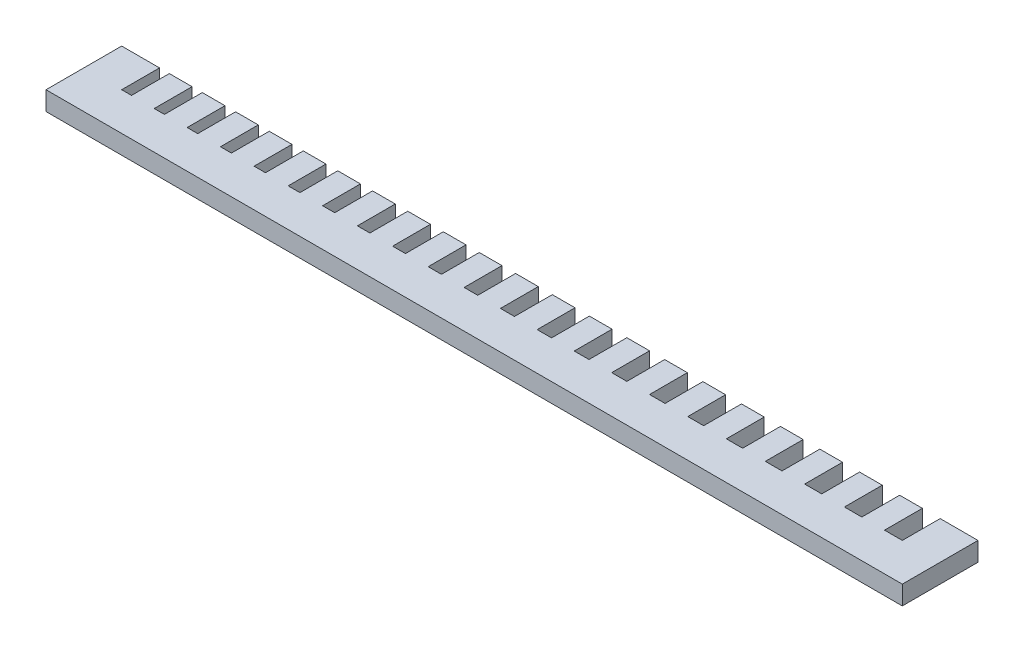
ISO-10303-21;
HEADER;
FILE_DESCRIPTION(('STEP AP214'),'2;1');
FILE_NAME('part.step','',(''),(''),'','','');
FILE_SCHEMA(('AUTOMOTIVE_DESIGN { 1 0 10303 214 1 1 1 1 }'));
ENDSEC;
DATA;
#1=APPLICATION_CONTEXT('core data for automotive mechanical design processes');
#2=APPLICATION_PROTOCOL_DEFINITION('international standard','automotive_design',2000,#1);
#3=PRODUCT_CONTEXT('',#1,'mechanical');
#4=PRODUCT('Part','Part','',(#3));
#5=PRODUCT_RELATED_PRODUCT_CATEGORY('part','',(#4));
#6=PRODUCT_DEFINITION_FORMATION('','',#4);
#7=PRODUCT_DEFINITION_CONTEXT('part definition',#1,'design');
#8=PRODUCT_DEFINITION('design','',#6,#7);
#9=PRODUCT_DEFINITION_SHAPE('','',#8);
#10=(LENGTH_UNIT() NAMED_UNIT(*) SI_UNIT(.MILLI.,.METRE.));
#11=(NAMED_UNIT(*) PLANE_ANGLE_UNIT() SI_UNIT($,.RADIAN.));
#12=(NAMED_UNIT(*) SI_UNIT($,.STERADIAN.) SOLID_ANGLE_UNIT());
#13=UNCERTAINTY_MEASURE_WITH_UNIT(LENGTH_MEASURE(1.E-05),#10,'distance_accuracy_value','');
#14=(GEOMETRIC_REPRESENTATION_CONTEXT(3) GLOBAL_UNCERTAINTY_ASSIGNED_CONTEXT((#13)) GLOBAL_UNIT_ASSIGNED_CONTEXT((#10,
#11,#12)) REPRESENTATION_CONTEXT('',''));
#15=CARTESIAN_POINT('',(0.,0.,0.));
#16=DIRECTION('',(0.,0.,1.));
#17=DIRECTION('',(1.,0.,0.));
#18=AXIS2_PLACEMENT_3D('',#15,#16,#17);
#19=CARTESIAN_POINT('',(0.,5.,0.));
#20=DIRECTION('',(-1.,0.,0.));
#21=DIRECTION('',(0.,0.,1.));
#22=AXIS2_PLACEMENT_3D('',#19,#20,#21);
#23=PLANE('',#22);
#24=DIRECTION('',(0.,0.,-1.));
#25=VECTOR('',#24,1.);
#26=CARTESIAN_POINT('',(0.,5.,0.));
#27=LINE('',#26,#25);
#28=CARTESIAN_POINT('',(0.,5.,0.));
#29=VERTEX_POINT('',#28);
#30=CARTESIAN_POINT('',(0.,5.,-20.));
#31=VERTEX_POINT('',#30);
#32=EDGE_CURVE('E84',#29,#31,#27,.T.);
#33=ORIENTED_EDGE('',*,*,#32,.T.);
#34=DIRECTION('',(0.,-1.,0.));
#35=VECTOR('',#34,1.);
#36=CARTESIAN_POINT('',(0.,5.,-20.));
#37=LINE('',#36,#35);
#38=CARTESIAN_POINT('',(0.,0.,-20.));
#39=VERTEX_POINT('',#38);
#40=EDGE_CURVE('E88',#31,#39,#37,.T.);
#41=ORIENTED_EDGE('',*,*,#40,.T.);
#42=DIRECTION('',(0.,0.,-1.));
#43=VECTOR('',#42,1.);
#44=CARTESIAN_POINT('',(0.,0.,0.));
#45=LINE('',#44,#43);
#46=CARTESIAN_POINT('',(0.,0.,0.));
#47=VERTEX_POINT('',#46);
#48=EDGE_CURVE('E81',#47,#39,#45,.T.);
#49=ORIENTED_EDGE('',*,*,#48,.F.);
#50=DIRECTION('',(0.,-1.,0.));
#51=VECTOR('',#50,1.);
#52=CARTESIAN_POINT('',(0.,5.,0.));
#53=LINE('',#52,#51);
#54=EDGE_CURVE('E11',#29,#47,#53,.T.);
#55=ORIENTED_EDGE('',*,*,#54,.F.);
#56=EDGE_LOOP('',(#33,#41,#49,#55));
#57=FACE_BOUND('',#56,.T.);
#58=ADVANCED_FACE('F35',(#57),#23,.T.);
#59=CARTESIAN_POINT('',(226.3,5.,0.));
#60=DIRECTION('',(-1.,0.,0.));
#61=DIRECTION('',(0.,0.,1.));
#62=AXIS2_PLACEMENT_3D('',#59,#60,#61);
#63=PLANE('',#62);
#64=DIRECTION('',(0.,-1.,0.));
#65=VECTOR('',#64,1.);
#66=CARTESIAN_POINT('',(226.3,5.,-20.002705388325));
#67=LINE('',#66,#65);
#68=CARTESIAN_POINT('',(226.3,5.,-20.002705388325));
#69=VERTEX_POINT('',#68);
#70=CARTESIAN_POINT('',(226.3,0.,-20.002705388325));
#71=VERTEX_POINT('',#70);
#72=EDGE_CURVE('E89',#69,#71,#67,.T.);
#73=ORIENTED_EDGE('',*,*,#72,.F.);
#74=DIRECTION('',(0.,0.,-1.));
#75=VECTOR('',#74,1.);
#76=CARTESIAN_POINT('',(226.3,5.,0.));
#77=LINE('',#76,#75);
#78=CARTESIAN_POINT('',(226.3,5.,0.));
#79=VERTEX_POINT('',#78);
#80=EDGE_CURVE('E95',#79,#69,#77,.T.);
#81=ORIENTED_EDGE('',*,*,#80,.F.);
#82=DIRECTION('',(0.,-1.,0.));
#83=VECTOR('',#82,1.);
#84=CARTESIAN_POINT('',(226.3,5.,0.));
#85=LINE('',#84,#83);
#86=CARTESIAN_POINT('',(226.3,0.,0.));
#87=VERTEX_POINT('',#86);
#88=EDGE_CURVE('E38',#79,#87,#85,.T.);
#89=ORIENTED_EDGE('',*,*,#88,.T.);
#90=DIRECTION('',(0.,0.,-1.));
#91=VECTOR('',#90,1.);
#92=CARTESIAN_POINT('',(226.3,0.,0.));
#93=LINE('',#92,#91);
#94=EDGE_CURVE('E83',#87,#71,#93,.T.);
#95=ORIENTED_EDGE('',*,*,#94,.T.);
#96=EDGE_LOOP('',(#73,#81,#89,#95));
#97=FACE_BOUND('',#96,.T.);
#98=ADVANCED_FACE('F901',(#97),#63,.F.);
#99=CARTESIAN_POINT('',(0.,5.,0.));
#100=DIRECTION('',(0.,-1.,0.));
#101=DIRECTION('',(0.,0.,-1.));
#102=AXIS2_PLACEMENT_3D('',#99,#100,#101);
#103=PLANE('',#102);
#104=DIRECTION('',(1.,0.,0.));
#105=VECTOR('',#104,1.);
#106=CARTESIAN_POINT('',(216.3,5.,-20.002705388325));
#107=LINE('',#106,#105);
#108=CARTESIAN_POINT('',(216.3,5.,-20.002705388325));
#109=VERTEX_POINT('',#108);
#110=EDGE_CURVE('E366',#109,#69,#107,.T.);
#111=ORIENTED_EDGE('',*,*,#110,.F.);
#112=DIRECTION('',(0.,0.,-1.));
#113=VECTOR('',#112,1.);
#114=CARTESIAN_POINT('',(216.3,5.,-20.002705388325));
#115=LINE('',#114,#113);
#116=CARTESIAN_POINT('',(216.3,5.,-10.));
#117=VERTEX_POINT('',#116);
#118=EDGE_CURVE('E363',#117,#109,#115,.T.);
#119=ORIENTED_EDGE('',*,*,#118,.F.);
#120=DIRECTION('',(1.,0.,0.));
#121=VECTOR('',#120,1.);
#122=CARTESIAN_POINT('',(211.6,5.,-10.));
#123=LINE('',#122,#121);
#124=CARTESIAN_POINT('',(211.6,5.,-10.));
#125=VERTEX_POINT('',#124);
#126=EDGE_CURVE('E630',#125,#117,#123,.T.);
#127=ORIENTED_EDGE('',*,*,#126,.F.);
#128=DIRECTION('',(0.,0.,1.));
#129=VECTOR('',#128,1.);
#130=CARTESIAN_POINT('',(211.6,5.,-20.));
#131=LINE('',#130,#129);
#132=CARTESIAN_POINT('',(211.6,5.,-20.));
#133=VERTEX_POINT('',#132);
#134=EDGE_CURVE('E633',#133,#125,#131,.T.);
#135=ORIENTED_EDGE('',*,*,#134,.F.);
#136=DIRECTION('',(1.,0.,0.));
#137=VECTOR('',#136,1.);
#138=CARTESIAN_POINT('',(205.6,5.,-20.));
#139=LINE('',#138,#137);
#140=CARTESIAN_POINT('',(205.6,5.,-20.));
#141=VERTEX_POINT('',#140);
#142=EDGE_CURVE('E636',#141,#133,#139,.T.);
#143=ORIENTED_EDGE('',*,*,#142,.F.);
#144=DIRECTION('',(0.,0.,-1.));
#145=VECTOR('',#144,1.);
#146=CARTESIAN_POINT('',(205.6,5.,-20.));
#147=LINE('',#146,#145);
#148=CARTESIAN_POINT('',(205.6,5.,-10.));
#149=VERTEX_POINT('',#148);
#150=EDGE_CURVE('E639',#149,#141,#147,.T.);
#151=ORIENTED_EDGE('',*,*,#150,.F.);
#152=DIRECTION('',(1.,0.,0.));
#153=VECTOR('',#152,1.);
#154=CARTESIAN_POINT('',(201.,5.,-10.));
#155=LINE('',#154,#153);
#156=CARTESIAN_POINT('',(201.,5.,-10.));
#157=VERTEX_POINT('',#156);
#158=EDGE_CURVE('E642',#157,#149,#155,.T.);
#159=ORIENTED_EDGE('',*,*,#158,.F.);
#160=DIRECTION('',(0.,0.,1.));
#161=VECTOR('',#160,1.);
#162=CARTESIAN_POINT('',(201.,5.,-20.));
#163=LINE('',#162,#161);
#164=CARTESIAN_POINT('',(201.,5.,-20.));
#165=VERTEX_POINT('',#164);
#166=EDGE_CURVE('E645',#165,#157,#163,.T.);
#167=ORIENTED_EDGE('',*,*,#166,.F.);
#168=DIRECTION('',(1.,0.,0.));
#169=VECTOR('',#168,1.);
#170=CARTESIAN_POINT('',(195.,5.,-20.));
#171=LINE('',#170,#169);
#172=CARTESIAN_POINT('',(195.,5.,-20.));
#173=VERTEX_POINT('',#172);
#174=EDGE_CURVE('E648',#173,#165,#171,.T.);
#175=ORIENTED_EDGE('',*,*,#174,.F.);
#176=DIRECTION('',(0.,0.,-1.));
#177=VECTOR('',#176,1.);
#178=CARTESIAN_POINT('',(195.,5.,-20.));
#179=LINE('',#178,#177);
#180=CARTESIAN_POINT('',(195.,5.,-10.));
#181=VERTEX_POINT('',#180);
#182=EDGE_CURVE('E651',#181,#173,#179,.T.);
#183=ORIENTED_EDGE('',*,*,#182,.F.);
#184=DIRECTION('',(1.,0.,0.));
#185=VECTOR('',#184,1.);
#186=CARTESIAN_POINT('',(190.5,5.,-10.));
#187=LINE('',#186,#185);
#188=CARTESIAN_POINT('',(190.5,5.,-10.));
#189=VERTEX_POINT('',#188);
#190=EDGE_CURVE('E654',#189,#181,#187,.T.);
#191=ORIENTED_EDGE('',*,*,#190,.F.);
#192=DIRECTION('',(0.,0.,1.));
#193=VECTOR('',#192,1.);
#194=CARTESIAN_POINT('',(190.5,5.,-20.));
#195=LINE('',#194,#193);
#196=CARTESIAN_POINT('',(190.5,5.,-20.));
#197=VERTEX_POINT('',#196);
#198=EDGE_CURVE('E657',#197,#189,#195,.T.);
#199=ORIENTED_EDGE('',*,*,#198,.F.);
#200=DIRECTION('',(1.,0.,0.));
#201=VECTOR('',#200,1.);
#202=CARTESIAN_POINT('',(184.5,5.,-20.));
#203=LINE('',#202,#201);
#204=CARTESIAN_POINT('',(184.5,5.,-20.));
#205=VERTEX_POINT('',#204);
#206=EDGE_CURVE('E660',#205,#197,#203,.T.);
#207=ORIENTED_EDGE('',*,*,#206,.F.);
#208=DIRECTION('',(0.,0.,-1.));
#209=VECTOR('',#208,1.);
#210=CARTESIAN_POINT('',(184.5,5.,-20.));
#211=LINE('',#210,#209);
#212=CARTESIAN_POINT('',(184.5,5.,-10.));
#213=VERTEX_POINT('',#212);
#214=EDGE_CURVE('E663',#213,#205,#211,.T.);
#215=ORIENTED_EDGE('',*,*,#214,.F.);
#216=DIRECTION('',(1.,0.,0.));
#217=VECTOR('',#216,1.);
#218=CARTESIAN_POINT('',(180.1,5.,-10.));
#219=LINE('',#218,#217);
#220=CARTESIAN_POINT('',(180.1,5.,-10.));
#221=VERTEX_POINT('',#220);
#222=EDGE_CURVE('E666',#221,#213,#219,.T.);
#223=ORIENTED_EDGE('',*,*,#222,.F.);
#224=DIRECTION('',(0.,0.,1.));
#225=VECTOR('',#224,1.);
#226=CARTESIAN_POINT('',(180.1,5.,-20.));
#227=LINE('',#226,#225);
#228=CARTESIAN_POINT('',(180.1,5.,-20.));
#229=VERTEX_POINT('',#228);
#230=EDGE_CURVE('E669',#229,#221,#227,.T.);
#231=ORIENTED_EDGE('',*,*,#230,.F.);
#232=DIRECTION('',(1.,0.,0.));
#233=VECTOR('',#232,1.);
#234=CARTESIAN_POINT('',(174.1,5.,-20.));
#235=LINE('',#234,#233);
#236=CARTESIAN_POINT('',(174.1,5.,-20.));
#237=VERTEX_POINT('',#236);
#238=EDGE_CURVE('E672',#237,#229,#235,.T.);
#239=ORIENTED_EDGE('',*,*,#238,.F.);
#240=DIRECTION('',(0.,0.,-1.));
#241=VECTOR('',#240,1.);
#242=CARTESIAN_POINT('',(174.1,5.,-20.));
#243=LINE('',#242,#241);
#244=CARTESIAN_POINT('',(174.1,5.,-10.));
#245=VERTEX_POINT('',#244);
#246=EDGE_CURVE('E675',#245,#237,#243,.T.);
#247=ORIENTED_EDGE('',*,*,#246,.F.);
#248=DIRECTION('',(1.,0.,0.));
#249=VECTOR('',#248,1.);
#250=CARTESIAN_POINT('',(169.8,5.,-10.));
#251=LINE('',#250,#249);
#252=CARTESIAN_POINT('',(169.8,5.,-10.));
#253=VERTEX_POINT('',#252);
#254=EDGE_CURVE('E678',#253,#245,#251,.T.);
#255=ORIENTED_EDGE('',*,*,#254,.F.);
#256=DIRECTION('',(0.,0.,1.));
#257=VECTOR('',#256,1.);
#258=CARTESIAN_POINT('',(169.8,5.,-20.));
#259=LINE('',#258,#257);
#260=CARTESIAN_POINT('',(169.8,5.,-20.));
#261=VERTEX_POINT('',#260);
#262=EDGE_CURVE('E681',#261,#253,#259,.T.);
#263=ORIENTED_EDGE('',*,*,#262,.F.);
#264=DIRECTION('',(1.,0.,0.));
#265=VECTOR('',#264,1.);
#266=CARTESIAN_POINT('',(163.8,5.,-20.));
#267=LINE('',#266,#265);
#268=CARTESIAN_POINT('',(163.8,5.,-20.));
#269=VERTEX_POINT('',#268);
#270=EDGE_CURVE('E684',#269,#261,#267,.T.);
#271=ORIENTED_EDGE('',*,*,#270,.F.);
#272=DIRECTION('',(0.,0.,-1.));
#273=VECTOR('',#272,1.);
#274=CARTESIAN_POINT('',(163.8,5.,-20.));
#275=LINE('',#274,#273);
#276=CARTESIAN_POINT('',(163.8,5.,-10.));
#277=VERTEX_POINT('',#276);
#278=EDGE_CURVE('E687',#277,#269,#275,.T.);
#279=ORIENTED_EDGE('',*,*,#278,.F.);
#280=DIRECTION('',(1.,0.,0.));
#281=VECTOR('',#280,1.);
#282=CARTESIAN_POINT('',(159.6,5.,-10.));
#283=LINE('',#282,#281);
#284=CARTESIAN_POINT('',(159.6,5.,-10.));
#285=VERTEX_POINT('',#284);
#286=EDGE_CURVE('E690',#285,#277,#283,.T.);
#287=ORIENTED_EDGE('',*,*,#286,.F.);
#288=DIRECTION('',(0.,0.,1.));
#289=VECTOR('',#288,1.);
#290=CARTESIAN_POINT('',(159.6,5.,-20.));
#291=LINE('',#290,#289);
#292=CARTESIAN_POINT('',(159.6,5.,-20.));
#293=VERTEX_POINT('',#292);
#294=EDGE_CURVE('E693',#293,#285,#291,.T.);
#295=ORIENTED_EDGE('',*,*,#294,.F.);
#296=DIRECTION('',(1.,0.,0.));
#297=VECTOR('',#296,1.);
#298=CARTESIAN_POINT('',(153.6,5.,-20.));
#299=LINE('',#298,#297);
#300=CARTESIAN_POINT('',(153.6,5.,-20.));
#301=VERTEX_POINT('',#300);
#302=EDGE_CURVE('E696',#301,#293,#299,.T.);
#303=ORIENTED_EDGE('',*,*,#302,.F.);
#304=DIRECTION('',(0.,0.,-1.));
#305=VECTOR('',#304,1.);
#306=CARTESIAN_POINT('',(153.6,5.,-20.));
#307=LINE('',#306,#305);
#308=CARTESIAN_POINT('',(153.6,5.,-10.));
#309=VERTEX_POINT('',#308);
#310=EDGE_CURVE('E699',#309,#301,#307,.T.);
#311=ORIENTED_EDGE('',*,*,#310,.F.);
#312=DIRECTION('',(1.,0.,0.));
#313=VECTOR('',#312,1.);
#314=CARTESIAN_POINT('',(149.5,5.,-10.));
#315=LINE('',#314,#313);
#316=CARTESIAN_POINT('',(149.5,5.,-10.));
#317=VERTEX_POINT('',#316);
#318=EDGE_CURVE('E702',#317,#309,#315,.T.);
#319=ORIENTED_EDGE('',*,*,#318,.F.);
#320=DIRECTION('',(0.,0.,1.));
#321=VECTOR('',#320,1.);
#322=CARTESIAN_POINT('',(149.5,5.,-20.));
#323=LINE('',#322,#321);
#324=CARTESIAN_POINT('',(149.5,5.,-20.));
#325=VERTEX_POINT('',#324);
#326=EDGE_CURVE('E705',#325,#317,#323,.T.);
#327=ORIENTED_EDGE('',*,*,#326,.F.);
#328=DIRECTION('',(1.,0.,0.));
#329=VECTOR('',#328,1.);
#330=CARTESIAN_POINT('',(143.5,5.,-20.));
#331=LINE('',#330,#329);
#332=CARTESIAN_POINT('',(143.5,5.,-20.));
#333=VERTEX_POINT('',#332);
#334=EDGE_CURVE('E708',#333,#325,#331,.T.);
#335=ORIENTED_EDGE('',*,*,#334,.F.);
#336=DIRECTION('',(0.,0.,-1.));
#337=VECTOR('',#336,1.);
#338=CARTESIAN_POINT('',(143.5,5.,-20.));
#339=LINE('',#338,#337);
#340=CARTESIAN_POINT('',(143.5,5.,-10.));
#341=VERTEX_POINT('',#340);
#342=EDGE_CURVE('E711',#341,#333,#339,.T.);
#343=ORIENTED_EDGE('',*,*,#342,.F.);
#344=DIRECTION('',(1.,0.,0.));
#345=VECTOR('',#344,1.);
#346=CARTESIAN_POINT('',(139.5,5.,-10.));
#347=LINE('',#346,#345);
#348=CARTESIAN_POINT('',(139.5,5.,-10.));
#349=VERTEX_POINT('',#348);
#350=EDGE_CURVE('E714',#349,#341,#347,.T.);
#351=ORIENTED_EDGE('',*,*,#350,.F.);
#352=DIRECTION('',(0.,0.,1.));
#353=VECTOR('',#352,1.);
#354=CARTESIAN_POINT('',(139.5,5.,-20.));
#355=LINE('',#354,#353);
#356=CARTESIAN_POINT('',(139.5,5.,-20.));
#357=VERTEX_POINT('',#356);
#358=EDGE_CURVE('E717',#357,#349,#355,.T.);
#359=ORIENTED_EDGE('',*,*,#358,.F.);
#360=DIRECTION('',(1.,0.,0.));
#361=VECTOR('',#360,1.);
#362=CARTESIAN_POINT('',(133.5,5.,-20.));
#363=LINE('',#362,#361);
#364=CARTESIAN_POINT('',(133.5,5.,-20.));
#365=VERTEX_POINT('',#364);
#366=EDGE_CURVE('E720',#365,#357,#363,.T.);
#367=ORIENTED_EDGE('',*,*,#366,.F.);
#368=DIRECTION('',(0.,0.,-1.));
#369=VECTOR('',#368,1.);
#370=CARTESIAN_POINT('',(133.5,5.,-20.));
#371=LINE('',#370,#369);
#372=CARTESIAN_POINT('',(133.5,5.,-10.));
#373=VERTEX_POINT('',#372);
#374=EDGE_CURVE('E723',#373,#365,#371,.T.);
#375=ORIENTED_EDGE('',*,*,#374,.F.);
#376=DIRECTION('',(1.,0.,0.));
#377=VECTOR('',#376,1.);
#378=CARTESIAN_POINT('',(129.6,5.,-10.));
#379=LINE('',#378,#377);
#380=CARTESIAN_POINT('',(129.6,5.,-10.));
#381=VERTEX_POINT('',#380);
#382=EDGE_CURVE('E726',#381,#373,#379,.T.);
#383=ORIENTED_EDGE('',*,*,#382,.F.);
#384=DIRECTION('',(0.,0.,1.));
#385=VECTOR('',#384,1.);
#386=CARTESIAN_POINT('',(129.6,5.,-20.));
#387=LINE('',#386,#385);
#388=CARTESIAN_POINT('',(129.6,5.,-20.));
#389=VERTEX_POINT('',#388);
#390=EDGE_CURVE('E729',#389,#381,#387,.T.);
#391=ORIENTED_EDGE('',*,*,#390,.F.);
#392=DIRECTION('',(1.,0.,0.));
#393=VECTOR('',#392,1.);
#394=CARTESIAN_POINT('',(123.6,5.,-20.));
#395=LINE('',#394,#393);
#396=CARTESIAN_POINT('',(123.6,5.,-20.));
#397=VERTEX_POINT('',#396);
#398=EDGE_CURVE('E732',#397,#389,#395,.T.);
#399=ORIENTED_EDGE('',*,*,#398,.F.);
#400=DIRECTION('',(0.,0.,-1.));
#401=VECTOR('',#400,1.);
#402=CARTESIAN_POINT('',(123.6,5.,-20.));
#403=LINE('',#402,#401);
#404=CARTESIAN_POINT('',(123.6,5.,-10.));
#405=VERTEX_POINT('',#404);
#406=EDGE_CURVE('E735',#405,#397,#403,.T.);
#407=ORIENTED_EDGE('',*,*,#406,.F.);
#408=DIRECTION('',(1.,0.,0.));
#409=VECTOR('',#408,1.);
#410=CARTESIAN_POINT('',(119.8,5.,-10.));
#411=LINE('',#410,#409);
#412=CARTESIAN_POINT('',(119.8,5.,-10.));
#413=VERTEX_POINT('',#412);
#414=EDGE_CURVE('E738',#413,#405,#411,.T.);
#415=ORIENTED_EDGE('',*,*,#414,.F.);
#416=DIRECTION('',(0.,0.,1.));
#417=VECTOR('',#416,1.);
#418=CARTESIAN_POINT('',(119.8,5.,-20.));
#419=LINE('',#418,#417);
#420=CARTESIAN_POINT('',(119.8,5.,-20.));
#421=VERTEX_POINT('',#420);
#422=EDGE_CURVE('E741',#421,#413,#419,.T.);
#423=ORIENTED_EDGE('',*,*,#422,.F.);
#424=DIRECTION('',(1.,0.,0.));
#425=VECTOR('',#424,1.);
#426=CARTESIAN_POINT('',(113.8,5.,-20.));
#427=LINE('',#426,#425);
#428=CARTESIAN_POINT('',(113.8,5.,-20.));
#429=VERTEX_POINT('',#428);
#430=EDGE_CURVE('E744',#429,#421,#427,.T.);
#431=ORIENTED_EDGE('',*,*,#430,.F.);
#432=DIRECTION('',(0.,0.,-1.));
#433=VECTOR('',#432,1.);
#434=CARTESIAN_POINT('',(113.8,5.,-20.));
#435=LINE('',#434,#433);
#436=CARTESIAN_POINT('',(113.8,5.,-10.));
#437=VERTEX_POINT('',#436);
#438=EDGE_CURVE('E747',#437,#429,#435,.T.);
#439=ORIENTED_EDGE('',*,*,#438,.F.);
#440=DIRECTION('',(1.,0.,0.));
#441=VECTOR('',#440,1.);
#442=CARTESIAN_POINT('',(110.1,5.,-10.));
#443=LINE('',#442,#441);
#444=CARTESIAN_POINT('',(110.1,5.,-10.));
#445=VERTEX_POINT('',#444);
#446=EDGE_CURVE('E750',#445,#437,#443,.T.);
#447=ORIENTED_EDGE('',*,*,#446,.F.);
#448=DIRECTION('',(0.,0.,1.));
#449=VECTOR('',#448,1.);
#450=CARTESIAN_POINT('',(110.1,5.,-20.));
#451=LINE('',#450,#449);
#452=CARTESIAN_POINT('',(110.1,5.,-20.));
#453=VERTEX_POINT('',#452);
#454=EDGE_CURVE('E753',#453,#445,#451,.T.);
#455=ORIENTED_EDGE('',*,*,#454,.F.);
#456=DIRECTION('',(1.,0.,0.));
#457=VECTOR('',#456,1.);
#458=CARTESIAN_POINT('',(104.1,5.,-20.));
#459=LINE('',#458,#457);
#460=CARTESIAN_POINT('',(104.1,5.,-20.));
#461=VERTEX_POINT('',#460);
#462=EDGE_CURVE('E756',#461,#453,#459,.T.);
#463=ORIENTED_EDGE('',*,*,#462,.F.);
#464=DIRECTION('',(0.,0.,-1.));
#465=VECTOR('',#464,1.);
#466=CARTESIAN_POINT('',(104.1,5.,-20.));
#467=LINE('',#466,#465);
#468=CARTESIAN_POINT('',(104.1,5.,-10.));
#469=VERTEX_POINT('',#468);
#470=EDGE_CURVE('E759',#469,#461,#467,.T.);
#471=ORIENTED_EDGE('',*,*,#470,.F.);
#472=DIRECTION('',(1.,0.,0.));
#473=VECTOR('',#472,1.);
#474=CARTESIAN_POINT('',(100.5,5.,-10.));
#475=LINE('',#474,#473);
#476=CARTESIAN_POINT('',(100.5,5.,-10.));
#477=VERTEX_POINT('',#476);
#478=EDGE_CURVE('E762',#477,#469,#475,.T.);
#479=ORIENTED_EDGE('',*,*,#478,.F.);
#480=DIRECTION('',(0.,0.,1.));
#481=VECTOR('',#480,1.);
#482=CARTESIAN_POINT('',(100.5,5.,-20.));
#483=LINE('',#482,#481);
#484=CARTESIAN_POINT('',(100.5,5.,-20.));
#485=VERTEX_POINT('',#484);
#486=EDGE_CURVE('E765',#485,#477,#483,.T.);
#487=ORIENTED_EDGE('',*,*,#486,.F.);
#488=DIRECTION('',(1.,0.,0.));
#489=VECTOR('',#488,1.);
#490=CARTESIAN_POINT('',(94.5,5.,-20.));
#491=LINE('',#490,#489);
#492=CARTESIAN_POINT('',(94.5,5.,-20.));
#493=VERTEX_POINT('',#492);
#494=EDGE_CURVE('E768',#493,#485,#491,.T.);
#495=ORIENTED_EDGE('',*,*,#494,.F.);
#496=DIRECTION('',(0.,0.,-1.));
#497=VECTOR('',#496,1.);
#498=CARTESIAN_POINT('',(94.5,5.,-20.));
#499=LINE('',#498,#497);
#500=CARTESIAN_POINT('',(94.5,5.,-10.));
#501=VERTEX_POINT('',#500);
#502=EDGE_CURVE('E771',#501,#493,#499,.T.);
#503=ORIENTED_EDGE('',*,*,#502,.F.);
#504=DIRECTION('',(1.,0.,0.));
#505=VECTOR('',#504,1.);
#506=CARTESIAN_POINT('',(91.,5.,-10.));
#507=LINE('',#506,#505);
#508=CARTESIAN_POINT('',(91.,5.,-10.));
#509=VERTEX_POINT('',#508);
#510=EDGE_CURVE('E774',#509,#501,#507,.T.);
#511=ORIENTED_EDGE('',*,*,#510,.F.);
#512=DIRECTION('',(0.,0.,1.));
#513=VECTOR('',#512,1.);
#514=CARTESIAN_POINT('',(91.,5.,-20.));
#515=LINE('',#514,#513);
#516=CARTESIAN_POINT('',(91.,5.,-20.));
#517=VERTEX_POINT('',#516);
#518=EDGE_CURVE('E777',#517,#509,#515,.T.);
#519=ORIENTED_EDGE('',*,*,#518,.F.);
#520=DIRECTION('',(1.,0.,0.));
#521=VECTOR('',#520,1.);
#522=CARTESIAN_POINT('',(85.,5.,-20.));
#523=LINE('',#522,#521);
#524=CARTESIAN_POINT('',(85.,5.,-20.));
#525=VERTEX_POINT('',#524);
#526=EDGE_CURVE('E780',#525,#517,#523,.T.);
#527=ORIENTED_EDGE('',*,*,#526,.F.);
#528=DIRECTION('',(0.,0.,-1.));
#529=VECTOR('',#528,1.);
#530=CARTESIAN_POINT('',(85.,5.,-20.));
#531=LINE('',#530,#529);
#532=CARTESIAN_POINT('',(85.,5.,-10.));
#533=VERTEX_POINT('',#532);
#534=EDGE_CURVE('E783',#533,#525,#531,.T.);
#535=ORIENTED_EDGE('',*,*,#534,.F.);
#536=DIRECTION('',(1.,0.,0.));
#537=VECTOR('',#536,1.);
#538=CARTESIAN_POINT('',(81.6,5.,-10.));
#539=LINE('',#538,#537);
#540=CARTESIAN_POINT('',(81.6,5.,-10.));
#541=VERTEX_POINT('',#540);
#542=EDGE_CURVE('E786',#541,#533,#539,.T.);
#543=ORIENTED_EDGE('',*,*,#542,.F.);
#544=DIRECTION('',(0.,0.,1.));
#545=VECTOR('',#544,1.);
#546=CARTESIAN_POINT('',(81.6,5.,-20.));
#547=LINE('',#546,#545);
#548=CARTESIAN_POINT('',(81.6,5.,-20.));
#549=VERTEX_POINT('',#548);
#550=EDGE_CURVE('E789',#549,#541,#547,.T.);
#551=ORIENTED_EDGE('',*,*,#550,.F.);
#552=DIRECTION('',(1.,0.,0.));
#553=VECTOR('',#552,1.);
#554=CARTESIAN_POINT('',(75.6,5.,-20.));
#555=LINE('',#554,#553);
#556=CARTESIAN_POINT('',(75.6,5.,-20.));
#557=VERTEX_POINT('',#556);
#558=EDGE_CURVE('E792',#557,#549,#555,.T.);
#559=ORIENTED_EDGE('',*,*,#558,.F.);
#560=DIRECTION('',(0.,0.,-1.));
#561=VECTOR('',#560,1.);
#562=CARTESIAN_POINT('',(75.6,5.,-20.));
#563=LINE('',#562,#561);
#564=CARTESIAN_POINT('',(75.6,5.,-10.));
#565=VERTEX_POINT('',#564);
#566=EDGE_CURVE('E795',#565,#557,#563,.T.);
#567=ORIENTED_EDGE('',*,*,#566,.F.);
#568=DIRECTION('',(1.,0.,0.));
#569=VECTOR('',#568,1.);
#570=CARTESIAN_POINT('',(72.3,5.,-10.));
#571=LINE('',#570,#569);
#572=CARTESIAN_POINT('',(72.3,5.,-10.));
#573=VERTEX_POINT('',#572);
#574=EDGE_CURVE('E798',#573,#565,#571,.T.);
#575=ORIENTED_EDGE('',*,*,#574,.F.);
#576=DIRECTION('',(0.,0.,1.));
#577=VECTOR('',#576,1.);
#578=CARTESIAN_POINT('',(72.3,5.,-20.));
#579=LINE('',#578,#577);
#580=CARTESIAN_POINT('',(72.3,5.,-20.));
#581=VERTEX_POINT('',#580);
#582=EDGE_CURVE('E801',#581,#573,#579,.T.);
#583=ORIENTED_EDGE('',*,*,#582,.F.);
#584=DIRECTION('',(1.,0.,0.));
#585=VECTOR('',#584,1.);
#586=CARTESIAN_POINT('',(66.3,5.,-20.));
#587=LINE('',#586,#585);
#588=CARTESIAN_POINT('',(66.3,5.,-20.));
#589=VERTEX_POINT('',#588);
#590=EDGE_CURVE('E804',#589,#581,#587,.T.);
#591=ORIENTED_EDGE('',*,*,#590,.F.);
#592=DIRECTION('',(0.,0.,-1.));
#593=VECTOR('',#592,1.);
#594=CARTESIAN_POINT('',(66.3,5.,-20.));
#595=LINE('',#594,#593);
#596=CARTESIAN_POINT('',(66.3,5.,-10.));
#597=VERTEX_POINT('',#596);
#598=EDGE_CURVE('E807',#597,#589,#595,.T.);
#599=ORIENTED_EDGE('',*,*,#598,.F.);
#600=DIRECTION('',(1.,0.,0.));
#601=VECTOR('',#600,1.);
#602=CARTESIAN_POINT('',(63.1,5.,-10.));
#603=LINE('',#602,#601);
#604=CARTESIAN_POINT('',(63.1,5.,-10.));
#605=VERTEX_POINT('',#604);
#606=EDGE_CURVE('E810',#605,#597,#603,.T.);
#607=ORIENTED_EDGE('',*,*,#606,.F.);
#608=DIRECTION('',(0.,0.,1.));
#609=VECTOR('',#608,1.);
#610=CARTESIAN_POINT('',(63.1,5.,-20.));
#611=LINE('',#610,#609);
#612=CARTESIAN_POINT('',(63.1,5.,-20.));
#613=VERTEX_POINT('',#612);
#614=EDGE_CURVE('E813',#613,#605,#611,.T.);
#615=ORIENTED_EDGE('',*,*,#614,.F.);
#616=DIRECTION('',(1.,0.,0.));
#617=VECTOR('',#616,1.);
#618=CARTESIAN_POINT('',(57.1,5.,-20.));
#619=LINE('',#618,#617);
#620=CARTESIAN_POINT('',(57.1,5.,-20.));
#621=VERTEX_POINT('',#620);
#622=EDGE_CURVE('E816',#621,#613,#619,.T.);
#623=ORIENTED_EDGE('',*,*,#622,.F.);
#624=DIRECTION('',(0.,0.,-1.));
#625=VECTOR('',#624,1.);
#626=CARTESIAN_POINT('',(57.1,5.,-20.));
#627=LINE('',#626,#625);
#628=CARTESIAN_POINT('',(57.1,5.,-10.));
#629=VERTEX_POINT('',#628);
#630=EDGE_CURVE('E819',#629,#621,#627,.T.);
#631=ORIENTED_EDGE('',*,*,#630,.F.);
#632=DIRECTION('',(1.,0.,0.));
#633=VECTOR('',#632,1.);
#634=CARTESIAN_POINT('',(54.,5.,-10.));
#635=LINE('',#634,#633);
#636=CARTESIAN_POINT('',(54.,5.,-10.));
#637=VERTEX_POINT('',#636);
#638=EDGE_CURVE('E822',#637,#629,#635,.T.);
#639=ORIENTED_EDGE('',*,*,#638,.F.);
#640=DIRECTION('',(0.,0.,1.));
#641=VECTOR('',#640,1.);
#642=CARTESIAN_POINT('',(54.,5.,-20.));
#643=LINE('',#642,#641);
#644=CARTESIAN_POINT('',(54.,5.,-20.));
#645=VERTEX_POINT('',#644);
#646=EDGE_CURVE('E825',#645,#637,#643,.T.);
#647=ORIENTED_EDGE('',*,*,#646,.F.);
#648=DIRECTION('',(1.,0.,0.));
#649=VECTOR('',#648,1.);
#650=CARTESIAN_POINT('',(48.,5.,-20.));
#651=LINE('',#650,#649);
#652=CARTESIAN_POINT('',(48.,5.,-20.));
#653=VERTEX_POINT('',#652);
#654=EDGE_CURVE('E828',#653,#645,#651,.T.);
#655=ORIENTED_EDGE('',*,*,#654,.F.);
#656=DIRECTION('',(0.,0.,-1.));
#657=VECTOR('',#656,1.);
#658=CARTESIAN_POINT('',(48.,5.,-20.));
#659=LINE('',#658,#657);
#660=CARTESIAN_POINT('',(48.,5.,-10.));
#661=VERTEX_POINT('',#660);
#662=EDGE_CURVE('E831',#661,#653,#659,.T.);
#663=ORIENTED_EDGE('',*,*,#662,.F.);
#664=DIRECTION('',(1.,0.,0.));
#665=VECTOR('',#664,1.);
#666=CARTESIAN_POINT('',(45.,5.,-10.));
#667=LINE('',#666,#665);
#668=CARTESIAN_POINT('',(45.,5.,-10.));
#669=VERTEX_POINT('',#668);
#670=EDGE_CURVE('E834',#669,#661,#667,.T.);
#671=ORIENTED_EDGE('',*,*,#670,.F.);
#672=DIRECTION('',(0.,0.,1.));
#673=VECTOR('',#672,1.);
#674=CARTESIAN_POINT('',(45.,5.,-20.));
#675=LINE('',#674,#673);
#676=CARTESIAN_POINT('',(45.,5.,-20.));
#677=VERTEX_POINT('',#676);
#678=EDGE_CURVE('E837',#677,#669,#675,.T.);
#679=ORIENTED_EDGE('',*,*,#678,.F.);
#680=DIRECTION('',(1.,0.,0.));
#681=VECTOR('',#680,1.);
#682=CARTESIAN_POINT('',(39.,5.,-20.));
#683=LINE('',#682,#681);
#684=CARTESIAN_POINT('',(39.,5.,-20.));
#685=VERTEX_POINT('',#684);
#686=EDGE_CURVE('E840',#685,#677,#683,.T.);
#687=ORIENTED_EDGE('',*,*,#686,.F.);
#688=DIRECTION('',(0.,0.,-1.));
#689=VECTOR('',#688,1.);
#690=CARTESIAN_POINT('',(39.,5.,-20.));
#691=LINE('',#690,#689);
#692=CARTESIAN_POINT('',(39.,5.,-10.));
#693=VERTEX_POINT('',#692);
#694=EDGE_CURVE('E843',#693,#685,#691,.T.);
#695=ORIENTED_EDGE('',*,*,#694,.F.);
#696=DIRECTION('',(1.,0.,0.));
#697=VECTOR('',#696,1.);
#698=CARTESIAN_POINT('',(36.1,5.,-10.));
#699=LINE('',#698,#697);
#700=CARTESIAN_POINT('',(36.1,5.,-10.));
#701=VERTEX_POINT('',#700);
#702=EDGE_CURVE('E846',#701,#693,#699,.T.);
#703=ORIENTED_EDGE('',*,*,#702,.F.);
#704=DIRECTION('',(0.,0.,1.));
#705=VECTOR('',#704,1.);
#706=CARTESIAN_POINT('',(36.1,5.,-20.));
#707=LINE('',#706,#705);
#708=CARTESIAN_POINT('',(36.1,5.,-20.));
#709=VERTEX_POINT('',#708);
#710=EDGE_CURVE('E849',#709,#701,#707,.T.);
#711=ORIENTED_EDGE('',*,*,#710,.F.);
#712=DIRECTION('',(1.,0.,0.));
#713=VECTOR('',#712,1.);
#714=CARTESIAN_POINT('',(30.1,5.,-20.));
#715=LINE('',#714,#713);
#716=CARTESIAN_POINT('',(30.1,5.,-20.));
#717=VERTEX_POINT('',#716);
#718=EDGE_CURVE('E852',#717,#709,#715,.T.);
#719=ORIENTED_EDGE('',*,*,#718,.F.);
#720=DIRECTION('',(0.,0.,-1.));
#721=VECTOR('',#720,1.);
#722=CARTESIAN_POINT('',(30.1,5.,-20.));
#723=LINE('',#722,#721);
#724=CARTESIAN_POINT('',(30.1,5.,-10.));
#725=VERTEX_POINT('',#724);
#726=EDGE_CURVE('E855',#725,#717,#723,.T.);
#727=ORIENTED_EDGE('',*,*,#726,.F.);
#728=DIRECTION('',(1.,0.,0.));
#729=VECTOR('',#728,1.);
#730=CARTESIAN_POINT('',(27.3,5.,-10.));
#731=LINE('',#730,#729);
#732=CARTESIAN_POINT('',(27.3,5.,-10.));
#733=VERTEX_POINT('',#732);
#734=EDGE_CURVE('E858',#733,#725,#731,.T.);
#735=ORIENTED_EDGE('',*,*,#734,.F.);
#736=DIRECTION('',(0.,0.,1.));
#737=VECTOR('',#736,1.);
#738=CARTESIAN_POINT('',(27.3,5.,-20.));
#739=LINE('',#738,#737);
#740=CARTESIAN_POINT('',(27.3,5.,-20.));
#741=VERTEX_POINT('',#740);
#742=EDGE_CURVE('E861',#741,#733,#739,.T.);
#743=ORIENTED_EDGE('',*,*,#742,.F.);
#744=DIRECTION('',(1.,0.,0.));
#745=VECTOR('',#744,1.);
#746=CARTESIAN_POINT('',(21.3,5.,-20.));
#747=LINE('',#746,#745);
#748=CARTESIAN_POINT('',(21.3,5.,-20.));
#749=VERTEX_POINT('',#748);
#750=EDGE_CURVE('E864',#749,#741,#747,.T.);
#751=ORIENTED_EDGE('',*,*,#750,.F.);
#752=DIRECTION('',(0.,0.,-1.));
#753=VECTOR('',#752,1.);
#754=CARTESIAN_POINT('',(21.3,5.,-20.));
#755=LINE('',#754,#753);
#756=CARTESIAN_POINT('',(21.3,5.,-10.));
#757=VERTEX_POINT('',#756);
#758=EDGE_CURVE('E867',#757,#749,#755,.T.);
#759=ORIENTED_EDGE('',*,*,#758,.F.);
#760=DIRECTION('',(1.,0.,0.));
#761=VECTOR('',#760,1.);
#762=CARTESIAN_POINT('',(18.6,5.,-10.));
#763=LINE('',#762,#761);
#764=CARTESIAN_POINT('',(18.6,5.,-10.));
#765=VERTEX_POINT('',#764);
#766=EDGE_CURVE('E870',#765,#757,#763,.T.);
#767=ORIENTED_EDGE('',*,*,#766,.F.);
#768=DIRECTION('',(0.,0.,1.));
#769=VECTOR('',#768,1.);
#770=CARTESIAN_POINT('',(18.6,5.,-20.));
#771=LINE('',#770,#769);
#772=CARTESIAN_POINT('',(18.6,5.,-20.));
#773=VERTEX_POINT('',#772);
#774=EDGE_CURVE('E873',#773,#765,#771,.T.);
#775=ORIENTED_EDGE('',*,*,#774,.F.);
#776=DIRECTION('',(1.,0.,0.));
#777=VECTOR('',#776,1.);
#778=CARTESIAN_POINT('',(12.6,5.,-20.));
#779=LINE('',#778,#777);
#780=CARTESIAN_POINT('',(12.6,5.,-20.));
#781=VERTEX_POINT('',#780);
#782=EDGE_CURVE('E876',#781,#773,#779,.T.);
#783=ORIENTED_EDGE('',*,*,#782,.F.);
#784=DIRECTION('',(0.,0.,-1.));
#785=VECTOR('',#784,1.);
#786=CARTESIAN_POINT('',(12.6,5.,-20.));
#787=LINE('',#786,#785);
#788=CARTESIAN_POINT('',(12.6,5.,-10.));
#789=VERTEX_POINT('',#788);
#790=EDGE_CURVE('E879',#789,#781,#787,.T.);
#791=ORIENTED_EDGE('',*,*,#790,.F.);
#792=DIRECTION('',(1.,0.,0.));
#793=VECTOR('',#792,1.);
#794=CARTESIAN_POINT('',(10.,5.,-10.));
#795=LINE('',#794,#793);
#796=CARTESIAN_POINT('',(10.,5.,-10.));
#797=VERTEX_POINT('',#796);
#798=EDGE_CURVE('E882',#797,#789,#795,.T.);
#799=ORIENTED_EDGE('',*,*,#798,.F.);
#800=DIRECTION('',(0.,0.,1.));
#801=VECTOR('',#800,1.);
#802=CARTESIAN_POINT('',(10.,5.,-20.));
#803=LINE('',#802,#801);
#804=CARTESIAN_POINT('',(10.,5.,-20.));
#805=VERTEX_POINT('',#804);
#806=EDGE_CURVE('E885',#805,#797,#803,.T.);
#807=ORIENTED_EDGE('',*,*,#806,.F.);
#808=DIRECTION('',(1.,0.,0.));
#809=VECTOR('',#808,1.);
#810=CARTESIAN_POINT('',(0.,5.,-20.));
#811=LINE('',#810,#809);
#812=EDGE_CURVE('E888',#31,#805,#811,.T.);
#813=ORIENTED_EDGE('',*,*,#812,.F.);
#814=ORIENTED_EDGE('',*,*,#32,.F.);
#815=DIRECTION('',(1.,0.,0.));
#816=VECTOR('',#815,1.);
#817=CARTESIAN_POINT('',(0.,5.,0.));
#818=LINE('',#817,#816);
#819=EDGE_CURVE('E72',#29,#79,#818,.T.);
#820=ORIENTED_EDGE('',*,*,#819,.T.);
#821=ORIENTED_EDGE('',*,*,#80,.T.);
#822=EDGE_LOOP('',(#111,#119,#127,#135,#143,#151,#159,#167,#175,#183,#191,#199,#207,#215,#223,
#231,#239,#247,#255,#263,#271,#279,#287,#295,#303,#311,#319,#327,#335,#343,#351,#359,#367,#375,
#383,#391,#399,#407,#415,#423,#431,#439,#447,#455,#463,#471,#479,#487,#495,#503,#511,#519,#527,
#535,#543,#551,#559,#567,#575,#583,#591,#599,#607,#615,#623,#631,#639,#647,#655,#663,#671,#679,
#687,#695,#703,#711,#719,#727,#735,#743,#751,#759,#767,#775,#783,#791,#799,#807,#813,#814,#820,#821));
#823=FACE_BOUND('',#822,.T.);
#824=ADVANCED_FACE('F902',(#823),#103,.F.);
#825=CARTESIAN_POINT('',(0.,0.,0.));
#826=DIRECTION('',(0.,-1.,0.));
#827=DIRECTION('',(0.,0.,-1.));
#828=AXIS2_PLACEMENT_3D('',#825,#826,#827);
#829=PLANE('',#828);
#830=DIRECTION('',(0.,0.,-1.));
#831=VECTOR('',#830,1.);
#832=CARTESIAN_POINT('',(216.3,0.,-20.002705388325));
#833=LINE('',#832,#831);
#834=CARTESIAN_POINT('',(216.3,0.,-10.));
#835=VERTEX_POINT('',#834);
#836=CARTESIAN_POINT('',(216.3,0.,-20.002705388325));
#837=VERTEX_POINT('',#836);
#838=EDGE_CURVE('E364',#835,#837,#833,.T.);
#839=ORIENTED_EDGE('',*,*,#838,.T.);
#840=DIRECTION('',(1.,0.,0.));
#841=VECTOR('',#840,1.);
#842=CARTESIAN_POINT('',(216.3,0.,-20.002705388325));
#843=LINE('',#842,#841);
#844=EDGE_CURVE('E49',#837,#71,#843,.T.);
#845=ORIENTED_EDGE('',*,*,#844,.T.);
#846=ORIENTED_EDGE('',*,*,#94,.F.);
#847=DIRECTION('',(1.,0.,0.));
#848=VECTOR('',#847,1.);
#849=CARTESIAN_POINT('',(0.,0.,0.));
#850=LINE('',#849,#848);
#851=EDGE_CURVE('E70',#47,#87,#850,.T.);
#852=ORIENTED_EDGE('',*,*,#851,.F.);
#853=ORIENTED_EDGE('',*,*,#48,.T.);
#854=DIRECTION('',(1.,0.,0.));
#855=VECTOR('',#854,1.);
#856=CARTESIAN_POINT('',(0.,0.,-20.));
#857=LINE('',#856,#855);
#858=CARTESIAN_POINT('',(10.,0.,-20.));
#859=VERTEX_POINT('',#858);
#860=EDGE_CURVE('E625',#39,#859,#857,.T.);
#861=ORIENTED_EDGE('',*,*,#860,.T.);
#862=DIRECTION('',(0.,0.,1.));
#863=VECTOR('',#862,1.);
#864=CARTESIAN_POINT('',(10.,0.,-20.));
#865=LINE('',#864,#863);
#866=CARTESIAN_POINT('',(10.,0.,-10.));
#867=VERTEX_POINT('',#866);
#868=EDGE_CURVE('E622',#859,#867,#865,.T.);
#869=ORIENTED_EDGE('',*,*,#868,.T.);
#870=DIRECTION('',(1.,0.,0.));
#871=VECTOR('',#870,1.);
#872=CARTESIAN_POINT('',(10.,0.,-10.));
#873=LINE('',#872,#871);
#874=CARTESIAN_POINT('',(12.6,0.,-10.));
#875=VERTEX_POINT('',#874);
#876=EDGE_CURVE('E619',#867,#875,#873,.T.);
#877=ORIENTED_EDGE('',*,*,#876,.T.);
#878=DIRECTION('',(0.,0.,-1.));
#879=VECTOR('',#878,1.);
#880=CARTESIAN_POINT('',(12.6,0.,-20.));
#881=LINE('',#880,#879);
#882=CARTESIAN_POINT('',(12.6,0.,-20.));
#883=VERTEX_POINT('',#882);
#884=EDGE_CURVE('E616',#875,#883,#881,.T.);
#885=ORIENTED_EDGE('',*,*,#884,.T.);
#886=DIRECTION('',(1.,0.,0.));
#887=VECTOR('',#886,1.);
#888=CARTESIAN_POINT('',(12.6,0.,-20.));
#889=LINE('',#888,#887);
#890=CARTESIAN_POINT('',(18.6,0.,-20.));
#891=VERTEX_POINT('',#890);
#892=EDGE_CURVE('E613',#883,#891,#889,.T.);
#893=ORIENTED_EDGE('',*,*,#892,.T.);
#894=DIRECTION('',(0.,0.,1.));
#895=VECTOR('',#894,1.);
#896=CARTESIAN_POINT('',(18.6,0.,-20.));
#897=LINE('',#896,#895);
#898=CARTESIAN_POINT('',(18.6,0.,-10.));
#899=VERTEX_POINT('',#898);
#900=EDGE_CURVE('E610',#891,#899,#897,.T.);
#901=ORIENTED_EDGE('',*,*,#900,.T.);
#902=DIRECTION('',(1.,0.,0.));
#903=VECTOR('',#902,1.);
#904=CARTESIAN_POINT('',(18.6,0.,-10.));
#905=LINE('',#904,#903);
#906=CARTESIAN_POINT('',(21.3,0.,-10.));
#907=VERTEX_POINT('',#906);
#908=EDGE_CURVE('E607',#899,#907,#905,.T.);
#909=ORIENTED_EDGE('',*,*,#908,.T.);
#910=DIRECTION('',(0.,0.,-1.));
#911=VECTOR('',#910,1.);
#912=CARTESIAN_POINT('',(21.3,0.,-20.));
#913=LINE('',#912,#911);
#914=CARTESIAN_POINT('',(21.3,0.,-20.));
#915=VERTEX_POINT('',#914);
#916=EDGE_CURVE('E604',#907,#915,#913,.T.);
#917=ORIENTED_EDGE('',*,*,#916,.T.);
#918=DIRECTION('',(1.,0.,0.));
#919=VECTOR('',#918,1.);
#920=CARTESIAN_POINT('',(21.3,0.,-20.));
#921=LINE('',#920,#919);
#922=CARTESIAN_POINT('',(27.3,0.,-20.));
#923=VERTEX_POINT('',#922);
#924=EDGE_CURVE('E601',#915,#923,#921,.T.);
#925=ORIENTED_EDGE('',*,*,#924,.T.);
#926=DIRECTION('',(0.,0.,1.));
#927=VECTOR('',#926,1.);
#928=CARTESIAN_POINT('',(27.3,0.,-20.));
#929=LINE('',#928,#927);
#930=CARTESIAN_POINT('',(27.3,0.,-10.));
#931=VERTEX_POINT('',#930);
#932=EDGE_CURVE('E598',#923,#931,#929,.T.);
#933=ORIENTED_EDGE('',*,*,#932,.T.);
#934=DIRECTION('',(1.,0.,0.));
#935=VECTOR('',#934,1.);
#936=CARTESIAN_POINT('',(27.3,0.,-10.));
#937=LINE('',#936,#935);
#938=CARTESIAN_POINT('',(30.1,0.,-10.));
#939=VERTEX_POINT('',#938);
#940=EDGE_CURVE('E595',#931,#939,#937,.T.);
#941=ORIENTED_EDGE('',*,*,#940,.T.);
#942=DIRECTION('',(0.,0.,-1.));
#943=VECTOR('',#942,1.);
#944=CARTESIAN_POINT('',(30.1,0.,-20.));
#945=LINE('',#944,#943);
#946=CARTESIAN_POINT('',(30.1,0.,-20.));
#947=VERTEX_POINT('',#946);
#948=EDGE_CURVE('E592',#939,#947,#945,.T.);
#949=ORIENTED_EDGE('',*,*,#948,.T.);
#950=DIRECTION('',(1.,0.,0.));
#951=VECTOR('',#950,1.);
#952=CARTESIAN_POINT('',(30.1,0.,-20.));
#953=LINE('',#952,#951);
#954=CARTESIAN_POINT('',(36.1,0.,-20.));
#955=VERTEX_POINT('',#954);
#956=EDGE_CURVE('E589',#947,#955,#953,.T.);
#957=ORIENTED_EDGE('',*,*,#956,.T.);
#958=DIRECTION('',(0.,0.,1.));
#959=VECTOR('',#958,1.);
#960=CARTESIAN_POINT('',(36.1,0.,-20.));
#961=LINE('',#960,#959);
#962=CARTESIAN_POINT('',(36.1,0.,-10.));
#963=VERTEX_POINT('',#962);
#964=EDGE_CURVE('E586',#955,#963,#961,.T.);
#965=ORIENTED_EDGE('',*,*,#964,.T.);
#966=DIRECTION('',(1.,0.,0.));
#967=VECTOR('',#966,1.);
#968=CARTESIAN_POINT('',(36.1,0.,-10.));
#969=LINE('',#968,#967);
#970=CARTESIAN_POINT('',(39.,0.,-10.));
#971=VERTEX_POINT('',#970);
#972=EDGE_CURVE('E583',#963,#971,#969,.T.);
#973=ORIENTED_EDGE('',*,*,#972,.T.);
#974=DIRECTION('',(0.,0.,-1.));
#975=VECTOR('',#974,1.);
#976=CARTESIAN_POINT('',(39.,0.,-20.));
#977=LINE('',#976,#975);
#978=CARTESIAN_POINT('',(39.,0.,-20.));
#979=VERTEX_POINT('',#978);
#980=EDGE_CURVE('E580',#971,#979,#977,.T.);
#981=ORIENTED_EDGE('',*,*,#980,.T.);
#982=DIRECTION('',(1.,0.,0.));
#983=VECTOR('',#982,1.);
#984=CARTESIAN_POINT('',(39.,0.,-20.));
#985=LINE('',#984,#983);
#986=CARTESIAN_POINT('',(45.,0.,-20.));
#987=VERTEX_POINT('',#986);
#988=EDGE_CURVE('E577',#979,#987,#985,.T.);
#989=ORIENTED_EDGE('',*,*,#988,.T.);
#990=DIRECTION('',(0.,0.,1.));
#991=VECTOR('',#990,1.);
#992=CARTESIAN_POINT('',(45.,0.,-20.));
#993=LINE('',#992,#991);
#994=CARTESIAN_POINT('',(45.,0.,-10.));
#995=VERTEX_POINT('',#994);
#996=EDGE_CURVE('E574',#987,#995,#993,.T.);
#997=ORIENTED_EDGE('',*,*,#996,.T.);
#998=DIRECTION('',(1.,0.,0.));
#999=VECTOR('',#998,1.);
#1000=CARTESIAN_POINT('',(45.,0.,-10.));
#1001=LINE('',#1000,#999);
#1002=CARTESIAN_POINT('',(48.,0.,-10.));
#1003=VERTEX_POINT('',#1002);
#1004=EDGE_CURVE('E571',#995,#1003,#1001,.T.);
#1005=ORIENTED_EDGE('',*,*,#1004,.T.);
#1006=DIRECTION('',(0.,0.,-1.));
#1007=VECTOR('',#1006,1.);
#1008=CARTESIAN_POINT('',(48.,0.,-20.));
#1009=LINE('',#1008,#1007);
#1010=CARTESIAN_POINT('',(48.,0.,-20.));
#1011=VERTEX_POINT('',#1010);
#1012=EDGE_CURVE('E568',#1003,#1011,#1009,.T.);
#1013=ORIENTED_EDGE('',*,*,#1012,.T.);
#1014=DIRECTION('',(1.,0.,0.));
#1015=VECTOR('',#1014,1.);
#1016=CARTESIAN_POINT('',(48.,0.,-20.));
#1017=LINE('',#1016,#1015);
#1018=CARTESIAN_POINT('',(54.,0.,-20.));
#1019=VERTEX_POINT('',#1018);
#1020=EDGE_CURVE('E565',#1011,#1019,#1017,.T.);
#1021=ORIENTED_EDGE('',*,*,#1020,.T.);
#1022=DIRECTION('',(0.,0.,1.));
#1023=VECTOR('',#1022,1.);
#1024=CARTESIAN_POINT('',(54.,0.,-20.));
#1025=LINE('',#1024,#1023);
#1026=CARTESIAN_POINT('',(54.,0.,-10.));
#1027=VERTEX_POINT('',#1026);
#1028=EDGE_CURVE('E562',#1019,#1027,#1025,.T.);
#1029=ORIENTED_EDGE('',*,*,#1028,.T.);
#1030=DIRECTION('',(1.,0.,0.));
#1031=VECTOR('',#1030,1.);
#1032=CARTESIAN_POINT('',(54.,0.,-10.));
#1033=LINE('',#1032,#1031);
#1034=CARTESIAN_POINT('',(57.1,0.,-10.));
#1035=VERTEX_POINT('',#1034);
#1036=EDGE_CURVE('E559',#1027,#1035,#1033,.T.);
#1037=ORIENTED_EDGE('',*,*,#1036,.T.);
#1038=DIRECTION('',(0.,0.,-1.));
#1039=VECTOR('',#1038,1.);
#1040=CARTESIAN_POINT('',(57.1,0.,-20.));
#1041=LINE('',#1040,#1039);
#1042=CARTESIAN_POINT('',(57.1,0.,-20.));
#1043=VERTEX_POINT('',#1042);
#1044=EDGE_CURVE('E556',#1035,#1043,#1041,.T.);
#1045=ORIENTED_EDGE('',*,*,#1044,.T.);
#1046=DIRECTION('',(1.,0.,0.));
#1047=VECTOR('',#1046,1.);
#1048=CARTESIAN_POINT('',(57.1,0.,-20.));
#1049=LINE('',#1048,#1047);
#1050=CARTESIAN_POINT('',(63.1,0.,-20.));
#1051=VERTEX_POINT('',#1050);
#1052=EDGE_CURVE('E553',#1043,#1051,#1049,.T.);
#1053=ORIENTED_EDGE('',*,*,#1052,.T.);
#1054=DIRECTION('',(0.,0.,1.));
#1055=VECTOR('',#1054,1.);
#1056=CARTESIAN_POINT('',(63.1,0.,-20.));
#1057=LINE('',#1056,#1055);
#1058=CARTESIAN_POINT('',(63.1,0.,-10.));
#1059=VERTEX_POINT('',#1058);
#1060=EDGE_CURVE('E550',#1051,#1059,#1057,.T.);
#1061=ORIENTED_EDGE('',*,*,#1060,.T.);
#1062=DIRECTION('',(1.,0.,0.));
#1063=VECTOR('',#1062,1.);
#1064=CARTESIAN_POINT('',(63.1,0.,-10.));
#1065=LINE('',#1064,#1063);
#1066=CARTESIAN_POINT('',(66.3,0.,-10.));
#1067=VERTEX_POINT('',#1066);
#1068=EDGE_CURVE('E547',#1059,#1067,#1065,.T.);
#1069=ORIENTED_EDGE('',*,*,#1068,.T.);
#1070=DIRECTION('',(0.,0.,-1.));
#1071=VECTOR('',#1070,1.);
#1072=CARTESIAN_POINT('',(66.3,0.,-20.));
#1073=LINE('',#1072,#1071);
#1074=CARTESIAN_POINT('',(66.3,0.,-20.));
#1075=VERTEX_POINT('',#1074);
#1076=EDGE_CURVE('E544',#1067,#1075,#1073,.T.);
#1077=ORIENTED_EDGE('',*,*,#1076,.T.);
#1078=DIRECTION('',(1.,0.,0.));
#1079=VECTOR('',#1078,1.);
#1080=CARTESIAN_POINT('',(66.3,0.,-20.));
#1081=LINE('',#1080,#1079);
#1082=CARTESIAN_POINT('',(72.3,0.,-20.));
#1083=VERTEX_POINT('',#1082);
#1084=EDGE_CURVE('E541',#1075,#1083,#1081,.T.);
#1085=ORIENTED_EDGE('',*,*,#1084,.T.);
#1086=DIRECTION('',(0.,0.,1.));
#1087=VECTOR('',#1086,1.);
#1088=CARTESIAN_POINT('',(72.3,0.,-20.));
#1089=LINE('',#1088,#1087);
#1090=CARTESIAN_POINT('',(72.3,0.,-10.));
#1091=VERTEX_POINT('',#1090);
#1092=EDGE_CURVE('E538',#1083,#1091,#1089,.T.);
#1093=ORIENTED_EDGE('',*,*,#1092,.T.);
#1094=DIRECTION('',(1.,0.,0.));
#1095=VECTOR('',#1094,1.);
#1096=CARTESIAN_POINT('',(72.3,0.,-10.));
#1097=LINE('',#1096,#1095);
#1098=CARTESIAN_POINT('',(75.6,0.,-10.));
#1099=VERTEX_POINT('',#1098);
#1100=EDGE_CURVE('E535',#1091,#1099,#1097,.T.);
#1101=ORIENTED_EDGE('',*,*,#1100,.T.);
#1102=DIRECTION('',(0.,0.,-1.));
#1103=VECTOR('',#1102,1.);
#1104=CARTESIAN_POINT('',(75.6,0.,-20.));
#1105=LINE('',#1104,#1103);
#1106=CARTESIAN_POINT('',(75.6,0.,-20.));
#1107=VERTEX_POINT('',#1106);
#1108=EDGE_CURVE('E532',#1099,#1107,#1105,.T.);
#1109=ORIENTED_EDGE('',*,*,#1108,.T.);
#1110=DIRECTION('',(1.,0.,0.));
#1111=VECTOR('',#1110,1.);
#1112=CARTESIAN_POINT('',(75.6,0.,-20.));
#1113=LINE('',#1112,#1111);
#1114=CARTESIAN_POINT('',(81.6,0.,-20.));
#1115=VERTEX_POINT('',#1114);
#1116=EDGE_CURVE('E529',#1107,#1115,#1113,.T.);
#1117=ORIENTED_EDGE('',*,*,#1116,.T.);
#1118=DIRECTION('',(0.,0.,1.));
#1119=VECTOR('',#1118,1.);
#1120=CARTESIAN_POINT('',(81.6,0.,-20.));
#1121=LINE('',#1120,#1119);
#1122=CARTESIAN_POINT('',(81.6,0.,-10.));
#1123=VERTEX_POINT('',#1122);
#1124=EDGE_CURVE('E526',#1115,#1123,#1121,.T.);
#1125=ORIENTED_EDGE('',*,*,#1124,.T.);
#1126=DIRECTION('',(1.,0.,0.));
#1127=VECTOR('',#1126,1.);
#1128=CARTESIAN_POINT('',(81.6,0.,-10.));
#1129=LINE('',#1128,#1127);
#1130=CARTESIAN_POINT('',(85.,0.,-10.));
#1131=VERTEX_POINT('',#1130);
#1132=EDGE_CURVE('E523',#1123,#1131,#1129,.T.);
#1133=ORIENTED_EDGE('',*,*,#1132,.T.);
#1134=DIRECTION('',(0.,0.,-1.));
#1135=VECTOR('',#1134,1.);
#1136=CARTESIAN_POINT('',(85.,0.,-20.));
#1137=LINE('',#1136,#1135);
#1138=CARTESIAN_POINT('',(85.,0.,-20.));
#1139=VERTEX_POINT('',#1138);
#1140=EDGE_CURVE('E520',#1131,#1139,#1137,.T.);
#1141=ORIENTED_EDGE('',*,*,#1140,.T.);
#1142=DIRECTION('',(1.,0.,0.));
#1143=VECTOR('',#1142,1.);
#1144=CARTESIAN_POINT('',(85.,0.,-20.));
#1145=LINE('',#1144,#1143);
#1146=CARTESIAN_POINT('',(91.,0.,-20.));
#1147=VERTEX_POINT('',#1146);
#1148=EDGE_CURVE('E517',#1139,#1147,#1145,.T.);
#1149=ORIENTED_EDGE('',*,*,#1148,.T.);
#1150=DIRECTION('',(0.,0.,1.));
#1151=VECTOR('',#1150,1.);
#1152=CARTESIAN_POINT('',(91.,0.,-20.));
#1153=LINE('',#1152,#1151);
#1154=CARTESIAN_POINT('',(91.,0.,-10.));
#1155=VERTEX_POINT('',#1154);
#1156=EDGE_CURVE('E514',#1147,#1155,#1153,.T.);
#1157=ORIENTED_EDGE('',*,*,#1156,.T.);
#1158=DIRECTION('',(1.,0.,0.));
#1159=VECTOR('',#1158,1.);
#1160=CARTESIAN_POINT('',(91.,0.,-10.));
#1161=LINE('',#1160,#1159);
#1162=CARTESIAN_POINT('',(94.5,0.,-10.));
#1163=VERTEX_POINT('',#1162);
#1164=EDGE_CURVE('E511',#1155,#1163,#1161,.T.);
#1165=ORIENTED_EDGE('',*,*,#1164,.T.);
#1166=DIRECTION('',(0.,0.,-1.));
#1167=VECTOR('',#1166,1.);
#1168=CARTESIAN_POINT('',(94.5,0.,-20.));
#1169=LINE('',#1168,#1167);
#1170=CARTESIAN_POINT('',(94.5,0.,-20.));
#1171=VERTEX_POINT('',#1170);
#1172=EDGE_CURVE('E508',#1163,#1171,#1169,.T.);
#1173=ORIENTED_EDGE('',*,*,#1172,.T.);
#1174=DIRECTION('',(1.,0.,0.));
#1175=VECTOR('',#1174,1.);
#1176=CARTESIAN_POINT('',(94.5,0.,-20.));
#1177=LINE('',#1176,#1175);
#1178=CARTESIAN_POINT('',(100.5,0.,-20.));
#1179=VERTEX_POINT('',#1178);
#1180=EDGE_CURVE('E505',#1171,#1179,#1177,.T.);
#1181=ORIENTED_EDGE('',*,*,#1180,.T.);
#1182=DIRECTION('',(0.,0.,1.));
#1183=VECTOR('',#1182,1.);
#1184=CARTESIAN_POINT('',(100.5,0.,-20.));
#1185=LINE('',#1184,#1183);
#1186=CARTESIAN_POINT('',(100.5,0.,-10.));
#1187=VERTEX_POINT('',#1186);
#1188=EDGE_CURVE('E502',#1179,#1187,#1185,.T.);
#1189=ORIENTED_EDGE('',*,*,#1188,.T.);
#1190=DIRECTION('',(1.,0.,0.));
#1191=VECTOR('',#1190,1.);
#1192=CARTESIAN_POINT('',(100.5,0.,-10.));
#1193=LINE('',#1192,#1191);
#1194=CARTESIAN_POINT('',(104.1,0.,-10.));
#1195=VERTEX_POINT('',#1194);
#1196=EDGE_CURVE('E499',#1187,#1195,#1193,.T.);
#1197=ORIENTED_EDGE('',*,*,#1196,.T.);
#1198=DIRECTION('',(0.,0.,-1.));
#1199=VECTOR('',#1198,1.);
#1200=CARTESIAN_POINT('',(104.1,0.,-20.));
#1201=LINE('',#1200,#1199);
#1202=CARTESIAN_POINT('',(104.1,0.,-20.));
#1203=VERTEX_POINT('',#1202);
#1204=EDGE_CURVE('E496',#1195,#1203,#1201,.T.);
#1205=ORIENTED_EDGE('',*,*,#1204,.T.);
#1206=DIRECTION('',(1.,0.,0.));
#1207=VECTOR('',#1206,1.);
#1208=CARTESIAN_POINT('',(104.1,0.,-20.));
#1209=LINE('',#1208,#1207);
#1210=CARTESIAN_POINT('',(110.1,0.,-20.));
#1211=VERTEX_POINT('',#1210);
#1212=EDGE_CURVE('E493',#1203,#1211,#1209,.T.);
#1213=ORIENTED_EDGE('',*,*,#1212,.T.);
#1214=DIRECTION('',(0.,0.,1.));
#1215=VECTOR('',#1214,1.);
#1216=CARTESIAN_POINT('',(110.1,0.,-20.));
#1217=LINE('',#1216,#1215);
#1218=CARTESIAN_POINT('',(110.1,0.,-10.));
#1219=VERTEX_POINT('',#1218);
#1220=EDGE_CURVE('E490',#1211,#1219,#1217,.T.);
#1221=ORIENTED_EDGE('',*,*,#1220,.T.);
#1222=DIRECTION('',(1.,0.,0.));
#1223=VECTOR('',#1222,1.);
#1224=CARTESIAN_POINT('',(110.1,0.,-10.));
#1225=LINE('',#1224,#1223);
#1226=CARTESIAN_POINT('',(113.8,0.,-10.));
#1227=VERTEX_POINT('',#1226);
#1228=EDGE_CURVE('E487',#1219,#1227,#1225,.T.);
#1229=ORIENTED_EDGE('',*,*,#1228,.T.);
#1230=DIRECTION('',(0.,0.,-1.));
#1231=VECTOR('',#1230,1.);
#1232=CARTESIAN_POINT('',(113.8,0.,-20.));
#1233=LINE('',#1232,#1231);
#1234=CARTESIAN_POINT('',(113.8,0.,-20.));
#1235=VERTEX_POINT('',#1234);
#1236=EDGE_CURVE('E484',#1227,#1235,#1233,.T.);
#1237=ORIENTED_EDGE('',*,*,#1236,.T.);
#1238=DIRECTION('',(1.,0.,0.));
#1239=VECTOR('',#1238,1.);
#1240=CARTESIAN_POINT('',(113.8,0.,-20.));
#1241=LINE('',#1240,#1239);
#1242=CARTESIAN_POINT('',(119.8,0.,-20.));
#1243=VERTEX_POINT('',#1242);
#1244=EDGE_CURVE('E481',#1235,#1243,#1241,.T.);
#1245=ORIENTED_EDGE('',*,*,#1244,.T.);
#1246=DIRECTION('',(0.,0.,1.));
#1247=VECTOR('',#1246,1.);
#1248=CARTESIAN_POINT('',(119.8,0.,-20.));
#1249=LINE('',#1248,#1247);
#1250=CARTESIAN_POINT('',(119.8,0.,-10.));
#1251=VERTEX_POINT('',#1250);
#1252=EDGE_CURVE('E478',#1243,#1251,#1249,.T.);
#1253=ORIENTED_EDGE('',*,*,#1252,.T.);
#1254=DIRECTION('',(1.,0.,0.));
#1255=VECTOR('',#1254,1.);
#1256=CARTESIAN_POINT('',(119.8,0.,-10.));
#1257=LINE('',#1256,#1255);
#1258=CARTESIAN_POINT('',(123.6,0.,-10.));
#1259=VERTEX_POINT('',#1258);
#1260=EDGE_CURVE('E475',#1251,#1259,#1257,.T.);
#1261=ORIENTED_EDGE('',*,*,#1260,.T.);
#1262=DIRECTION('',(0.,0.,-1.));
#1263=VECTOR('',#1262,1.);
#1264=CARTESIAN_POINT('',(123.6,0.,-20.));
#1265=LINE('',#1264,#1263);
#1266=CARTESIAN_POINT('',(123.6,0.,-20.));
#1267=VERTEX_POINT('',#1266);
#1268=EDGE_CURVE('E472',#1259,#1267,#1265,.T.);
#1269=ORIENTED_EDGE('',*,*,#1268,.T.);
#1270=DIRECTION('',(1.,0.,0.));
#1271=VECTOR('',#1270,1.);
#1272=CARTESIAN_POINT('',(123.6,0.,-20.));
#1273=LINE('',#1272,#1271);
#1274=CARTESIAN_POINT('',(129.6,0.,-20.));
#1275=VERTEX_POINT('',#1274);
#1276=EDGE_CURVE('E469',#1267,#1275,#1273,.T.);
#1277=ORIENTED_EDGE('',*,*,#1276,.T.);
#1278=DIRECTION('',(0.,0.,1.));
#1279=VECTOR('',#1278,1.);
#1280=CARTESIAN_POINT('',(129.6,0.,-20.));
#1281=LINE('',#1280,#1279);
#1282=CARTESIAN_POINT('',(129.6,0.,-10.));
#1283=VERTEX_POINT('',#1282);
#1284=EDGE_CURVE('E466',#1275,#1283,#1281,.T.);
#1285=ORIENTED_EDGE('',*,*,#1284,.T.);
#1286=DIRECTION('',(1.,0.,0.));
#1287=VECTOR('',#1286,1.);
#1288=CARTESIAN_POINT('',(129.6,0.,-10.));
#1289=LINE('',#1288,#1287);
#1290=CARTESIAN_POINT('',(133.5,0.,-10.));
#1291=VERTEX_POINT('',#1290);
#1292=EDGE_CURVE('E463',#1283,#1291,#1289,.T.);
#1293=ORIENTED_EDGE('',*,*,#1292,.T.);
#1294=DIRECTION('',(0.,0.,-1.));
#1295=VECTOR('',#1294,1.);
#1296=CARTESIAN_POINT('',(133.5,0.,-20.));
#1297=LINE('',#1296,#1295);
#1298=CARTESIAN_POINT('',(133.5,0.,-20.));
#1299=VERTEX_POINT('',#1298);
#1300=EDGE_CURVE('E460',#1291,#1299,#1297,.T.);
#1301=ORIENTED_EDGE('',*,*,#1300,.T.);
#1302=DIRECTION('',(1.,0.,0.));
#1303=VECTOR('',#1302,1.);
#1304=CARTESIAN_POINT('',(133.5,0.,-20.));
#1305=LINE('',#1304,#1303);
#1306=CARTESIAN_POINT('',(139.5,0.,-20.));
#1307=VERTEX_POINT('',#1306);
#1308=EDGE_CURVE('E457',#1299,#1307,#1305,.T.);
#1309=ORIENTED_EDGE('',*,*,#1308,.T.);
#1310=DIRECTION('',(0.,0.,1.));
#1311=VECTOR('',#1310,1.);
#1312=CARTESIAN_POINT('',(139.5,0.,-20.));
#1313=LINE('',#1312,#1311);
#1314=CARTESIAN_POINT('',(139.5,0.,-10.));
#1315=VERTEX_POINT('',#1314);
#1316=EDGE_CURVE('E454',#1307,#1315,#1313,.T.);
#1317=ORIENTED_EDGE('',*,*,#1316,.T.);
#1318=DIRECTION('',(1.,0.,0.));
#1319=VECTOR('',#1318,1.);
#1320=CARTESIAN_POINT('',(139.5,0.,-10.));
#1321=LINE('',#1320,#1319);
#1322=CARTESIAN_POINT('',(143.5,0.,-10.));
#1323=VERTEX_POINT('',#1322);
#1324=EDGE_CURVE('E451',#1315,#1323,#1321,.T.);
#1325=ORIENTED_EDGE('',*,*,#1324,.T.);
#1326=DIRECTION('',(0.,0.,-1.));
#1327=VECTOR('',#1326,1.);
#1328=CARTESIAN_POINT('',(143.5,0.,-20.));
#1329=LINE('',#1328,#1327);
#1330=CARTESIAN_POINT('',(143.5,0.,-20.));
#1331=VERTEX_POINT('',#1330);
#1332=EDGE_CURVE('E448',#1323,#1331,#1329,.T.);
#1333=ORIENTED_EDGE('',*,*,#1332,.T.);
#1334=DIRECTION('',(1.,0.,0.));
#1335=VECTOR('',#1334,1.);
#1336=CARTESIAN_POINT('',(143.5,0.,-20.));
#1337=LINE('',#1336,#1335);
#1338=CARTESIAN_POINT('',(149.5,0.,-20.));
#1339=VERTEX_POINT('',#1338);
#1340=EDGE_CURVE('E445',#1331,#1339,#1337,.T.);
#1341=ORIENTED_EDGE('',*,*,#1340,.T.);
#1342=DIRECTION('',(0.,0.,1.));
#1343=VECTOR('',#1342,1.);
#1344=CARTESIAN_POINT('',(149.5,0.,-20.));
#1345=LINE('',#1344,#1343);
#1346=CARTESIAN_POINT('',(149.5,0.,-10.));
#1347=VERTEX_POINT('',#1346);
#1348=EDGE_CURVE('E442',#1339,#1347,#1345,.T.);
#1349=ORIENTED_EDGE('',*,*,#1348,.T.);
#1350=DIRECTION('',(1.,0.,0.));
#1351=VECTOR('',#1350,1.);
#1352=CARTESIAN_POINT('',(149.5,0.,-10.));
#1353=LINE('',#1352,#1351);
#1354=CARTESIAN_POINT('',(153.6,0.,-10.));
#1355=VERTEX_POINT('',#1354);
#1356=EDGE_CURVE('E439',#1347,#1355,#1353,.T.);
#1357=ORIENTED_EDGE('',*,*,#1356,.T.);
#1358=DIRECTION('',(0.,0.,-1.));
#1359=VECTOR('',#1358,1.);
#1360=CARTESIAN_POINT('',(153.6,0.,-20.));
#1361=LINE('',#1360,#1359);
#1362=CARTESIAN_POINT('',(153.6,0.,-20.));
#1363=VERTEX_POINT('',#1362);
#1364=EDGE_CURVE('E436',#1355,#1363,#1361,.T.);
#1365=ORIENTED_EDGE('',*,*,#1364,.T.);
#1366=DIRECTION('',(1.,0.,0.));
#1367=VECTOR('',#1366,1.);
#1368=CARTESIAN_POINT('',(153.6,0.,-20.));
#1369=LINE('',#1368,#1367);
#1370=CARTESIAN_POINT('',(159.6,0.,-20.));
#1371=VERTEX_POINT('',#1370);
#1372=EDGE_CURVE('E433',#1363,#1371,#1369,.T.);
#1373=ORIENTED_EDGE('',*,*,#1372,.T.);
#1374=DIRECTION('',(0.,0.,1.));
#1375=VECTOR('',#1374,1.);
#1376=CARTESIAN_POINT('',(159.6,0.,-20.));
#1377=LINE('',#1376,#1375);
#1378=CARTESIAN_POINT('',(159.6,0.,-10.));
#1379=VERTEX_POINT('',#1378);
#1380=EDGE_CURVE('E430',#1371,#1379,#1377,.T.);
#1381=ORIENTED_EDGE('',*,*,#1380,.T.);
#1382=DIRECTION('',(1.,0.,0.));
#1383=VECTOR('',#1382,1.);
#1384=CARTESIAN_POINT('',(159.6,0.,-10.));
#1385=LINE('',#1384,#1383);
#1386=CARTESIAN_POINT('',(163.8,0.,-10.));
#1387=VERTEX_POINT('',#1386);
#1388=EDGE_CURVE('E427',#1379,#1387,#1385,.T.);
#1389=ORIENTED_EDGE('',*,*,#1388,.T.);
#1390=DIRECTION('',(0.,0.,-1.));
#1391=VECTOR('',#1390,1.);
#1392=CARTESIAN_POINT('',(163.8,0.,-20.));
#1393=LINE('',#1392,#1391);
#1394=CARTESIAN_POINT('',(163.8,0.,-20.));
#1395=VERTEX_POINT('',#1394);
#1396=EDGE_CURVE('E424',#1387,#1395,#1393,.T.);
#1397=ORIENTED_EDGE('',*,*,#1396,.T.);
#1398=DIRECTION('',(1.,0.,0.));
#1399=VECTOR('',#1398,1.);
#1400=CARTESIAN_POINT('',(163.8,0.,-20.));
#1401=LINE('',#1400,#1399);
#1402=CARTESIAN_POINT('',(169.8,0.,-20.));
#1403=VERTEX_POINT('',#1402);
#1404=EDGE_CURVE('E421',#1395,#1403,#1401,.T.);
#1405=ORIENTED_EDGE('',*,*,#1404,.T.);
#1406=DIRECTION('',(0.,0.,1.));
#1407=VECTOR('',#1406,1.);
#1408=CARTESIAN_POINT('',(169.8,0.,-20.));
#1409=LINE('',#1408,#1407);
#1410=CARTESIAN_POINT('',(169.8,0.,-10.));
#1411=VERTEX_POINT('',#1410);
#1412=EDGE_CURVE('E418',#1403,#1411,#1409,.T.);
#1413=ORIENTED_EDGE('',*,*,#1412,.T.);
#1414=DIRECTION('',(1.,0.,0.));
#1415=VECTOR('',#1414,1.);
#1416=CARTESIAN_POINT('',(169.8,0.,-10.));
#1417=LINE('',#1416,#1415);
#1418=CARTESIAN_POINT('',(174.1,0.,-10.));
#1419=VERTEX_POINT('',#1418);
#1420=EDGE_CURVE('E415',#1411,#1419,#1417,.T.);
#1421=ORIENTED_EDGE('',*,*,#1420,.T.);
#1422=DIRECTION('',(0.,0.,-1.));
#1423=VECTOR('',#1422,1.);
#1424=CARTESIAN_POINT('',(174.1,0.,-20.));
#1425=LINE('',#1424,#1423);
#1426=CARTESIAN_POINT('',(174.1,0.,-20.));
#1427=VERTEX_POINT('',#1426);
#1428=EDGE_CURVE('E412',#1419,#1427,#1425,.T.);
#1429=ORIENTED_EDGE('',*,*,#1428,.T.);
#1430=DIRECTION('',(1.,0.,0.));
#1431=VECTOR('',#1430,1.);
#1432=CARTESIAN_POINT('',(174.1,0.,-20.));
#1433=LINE('',#1432,#1431);
#1434=CARTESIAN_POINT('',(180.1,0.,-20.));
#1435=VERTEX_POINT('',#1434);
#1436=EDGE_CURVE('E409',#1427,#1435,#1433,.T.);
#1437=ORIENTED_EDGE('',*,*,#1436,.T.);
#1438=DIRECTION('',(0.,0.,1.));
#1439=VECTOR('',#1438,1.);
#1440=CARTESIAN_POINT('',(180.1,0.,-20.));
#1441=LINE('',#1440,#1439);
#1442=CARTESIAN_POINT('',(180.1,0.,-10.));
#1443=VERTEX_POINT('',#1442);
#1444=EDGE_CURVE('E406',#1435,#1443,#1441,.T.);
#1445=ORIENTED_EDGE('',*,*,#1444,.T.);
#1446=DIRECTION('',(1.,0.,0.));
#1447=VECTOR('',#1446,1.);
#1448=CARTESIAN_POINT('',(180.1,0.,-10.));
#1449=LINE('',#1448,#1447);
#1450=CARTESIAN_POINT('',(184.5,0.,-10.));
#1451=VERTEX_POINT('',#1450);
#1452=EDGE_CURVE('E403',#1443,#1451,#1449,.T.);
#1453=ORIENTED_EDGE('',*,*,#1452,.T.);
#1454=DIRECTION('',(0.,0.,-1.));
#1455=VECTOR('',#1454,1.);
#1456=CARTESIAN_POINT('',(184.5,0.,-20.));
#1457=LINE('',#1456,#1455);
#1458=CARTESIAN_POINT('',(184.5,0.,-20.));
#1459=VERTEX_POINT('',#1458);
#1460=EDGE_CURVE('E400',#1451,#1459,#1457,.T.);
#1461=ORIENTED_EDGE('',*,*,#1460,.T.);
#1462=DIRECTION('',(1.,0.,0.));
#1463=VECTOR('',#1462,1.);
#1464=CARTESIAN_POINT('',(184.5,0.,-20.));
#1465=LINE('',#1464,#1463);
#1466=CARTESIAN_POINT('',(190.5,0.,-20.));
#1467=VERTEX_POINT('',#1466);
#1468=EDGE_CURVE('E397',#1459,#1467,#1465,.T.);
#1469=ORIENTED_EDGE('',*,*,#1468,.T.);
#1470=DIRECTION('',(0.,0.,1.));
#1471=VECTOR('',#1470,1.);
#1472=CARTESIAN_POINT('',(190.5,0.,-20.));
#1473=LINE('',#1472,#1471);
#1474=CARTESIAN_POINT('',(190.5,0.,-10.));
#1475=VERTEX_POINT('',#1474);
#1476=EDGE_CURVE('E394',#1467,#1475,#1473,.T.);
#1477=ORIENTED_EDGE('',*,*,#1476,.T.);
#1478=DIRECTION('',(1.,0.,0.));
#1479=VECTOR('',#1478,1.);
#1480=CARTESIAN_POINT('',(190.5,0.,-10.));
#1481=LINE('',#1480,#1479);
#1482=CARTESIAN_POINT('',(195.,0.,-10.));
#1483=VERTEX_POINT('',#1482);
#1484=EDGE_CURVE('E391',#1475,#1483,#1481,.T.);
#1485=ORIENTED_EDGE('',*,*,#1484,.T.);
#1486=DIRECTION('',(0.,0.,-1.));
#1487=VECTOR('',#1486,1.);
#1488=CARTESIAN_POINT('',(195.,0.,-20.));
#1489=LINE('',#1488,#1487);
#1490=CARTESIAN_POINT('',(195.,0.,-20.));
#1491=VERTEX_POINT('',#1490);
#1492=EDGE_CURVE('E388',#1483,#1491,#1489,.T.);
#1493=ORIENTED_EDGE('',*,*,#1492,.T.);
#1494=DIRECTION('',(1.,0.,0.));
#1495=VECTOR('',#1494,1.);
#1496=CARTESIAN_POINT('',(195.,0.,-20.));
#1497=LINE('',#1496,#1495);
#1498=CARTESIAN_POINT('',(201.,0.,-20.));
#1499=VERTEX_POINT('',#1498);
#1500=EDGE_CURVE('E385',#1491,#1499,#1497,.T.);
#1501=ORIENTED_EDGE('',*,*,#1500,.T.);
#1502=DIRECTION('',(0.,0.,1.));
#1503=VECTOR('',#1502,1.);
#1504=CARTESIAN_POINT('',(201.,0.,-20.));
#1505=LINE('',#1504,#1503);
#1506=CARTESIAN_POINT('',(201.,0.,-10.));
#1507=VERTEX_POINT('',#1506);
#1508=EDGE_CURVE('E382',#1499,#1507,#1505,.T.);
#1509=ORIENTED_EDGE('',*,*,#1508,.T.);
#1510=DIRECTION('',(1.,0.,0.));
#1511=VECTOR('',#1510,1.);
#1512=CARTESIAN_POINT('',(201.,0.,-10.));
#1513=LINE('',#1512,#1511);
#1514=CARTESIAN_POINT('',(205.6,0.,-10.));
#1515=VERTEX_POINT('',#1514);
#1516=EDGE_CURVE('E379',#1507,#1515,#1513,.T.);
#1517=ORIENTED_EDGE('',*,*,#1516,.T.);
#1518=DIRECTION('',(0.,0.,-1.));
#1519=VECTOR('',#1518,1.);
#1520=CARTESIAN_POINT('',(205.6,0.,-20.));
#1521=LINE('',#1520,#1519);
#1522=CARTESIAN_POINT('',(205.6,0.,-20.));
#1523=VERTEX_POINT('',#1522);
#1524=EDGE_CURVE('E376',#1515,#1523,#1521,.T.);
#1525=ORIENTED_EDGE('',*,*,#1524,.T.);
#1526=DIRECTION('',(1.,0.,0.));
#1527=VECTOR('',#1526,1.);
#1528=CARTESIAN_POINT('',(205.6,0.,-20.));
#1529=LINE('',#1528,#1527);
#1530=CARTESIAN_POINT('',(211.6,0.,-20.));
#1531=VERTEX_POINT('',#1530);
#1532=EDGE_CURVE('E373',#1523,#1531,#1529,.T.);
#1533=ORIENTED_EDGE('',*,*,#1532,.T.);
#1534=DIRECTION('',(0.,0.,1.));
#1535=VECTOR('',#1534,1.);
#1536=CARTESIAN_POINT('',(211.6,0.,-20.));
#1537=LINE('',#1536,#1535);
#1538=CARTESIAN_POINT('',(211.6,0.,-10.));
#1539=VERTEX_POINT('',#1538);
#1540=EDGE_CURVE('E370',#1531,#1539,#1537,.T.);
#1541=ORIENTED_EDGE('',*,*,#1540,.T.);
#1542=DIRECTION('',(1.,0.,0.));
#1543=VECTOR('',#1542,1.);
#1544=CARTESIAN_POINT('',(211.6,0.,-10.));
#1545=LINE('',#1544,#1543);
#1546=EDGE_CURVE('E367',#1539,#835,#1545,.T.);
#1547=ORIENTED_EDGE('',*,*,#1546,.T.);
#1548=EDGE_LOOP('',(#839,#845,#846,#852,#853,#861,#869,#877,#885,#893,#901,#909,#917,#925,#933,
#941,#949,#957,#965,#973,#981,#989,#997,#1005,#1013,#1021,#1029,#1037,#1045,#1053,#1061,#1069,
#1077,#1085,#1093,#1101,#1109,#1117,#1125,#1133,#1141,#1149,#1157,#1165,#1173,#1181,#1189,#1197,
#1205,#1213,#1221,#1229,#1237,#1245,#1253,#1261,#1269,#1277,#1285,#1293,#1301,#1309,#1317,#1325,
#1333,#1341,#1349,#1357,#1365,#1373,#1381,#1389,#1397,#1405,#1413,#1421,#1429,#1437,#1445,#1453,
#1461,#1469,#1477,#1485,#1493,#1501,#1509,#1517,#1525,#1533,#1541,#1547));
#1549=FACE_BOUND('',#1548,.T.);
#1550=ADVANCED_FACE('F78',(#1549),#829,.T.);
#1551=CARTESIAN_POINT('',(0.,5.,0.));
#1552=DIRECTION('',(0.,0.,-1.));
#1553=DIRECTION('',(-1.,0.,0.));
#1554=AXIS2_PLACEMENT_3D('',#1551,#1552,#1553);
#1555=PLANE('',#1554);
#1556=ORIENTED_EDGE('',*,*,#851,.T.);
#1557=ORIENTED_EDGE('',*,*,#88,.F.);
#1558=ORIENTED_EDGE('',*,*,#819,.F.);
#1559=ORIENTED_EDGE('',*,*,#54,.T.);
#1560=EDGE_LOOP('',(#1556,#1557,#1558,#1559));
#1561=FACE_BOUND('',#1560,.T.);
#1562=ADVANCED_FACE('F68',(#1561),#1555,.F.);
#1563=CARTESIAN_POINT('',(216.3,5.,-20.002705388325));
#1564=DIRECTION('',(0.,0.,-1.));
#1565=DIRECTION('',(-1.,0.,0.));
#1566=AXIS2_PLACEMENT_3D('',#1563,#1564,#1565);
#1567=PLANE('',#1566);
#1568=ORIENTED_EDGE('',*,*,#72,.T.);
#1569=ORIENTED_EDGE('',*,*,#844,.F.);
#1570=DIRECTION('',(0.,-1.,0.));
#1571=VECTOR('',#1570,1.);
#1572=CARTESIAN_POINT('',(216.3,5.,-20.002705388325));
#1573=LINE('',#1572,#1571);
#1574=EDGE_CURVE('E361',#109,#837,#1573,.T.);
#1575=ORIENTED_EDGE('',*,*,#1574,.F.);
#1576=ORIENTED_EDGE('',*,*,#110,.T.);
#1577=EDGE_LOOP('',(#1568,#1569,#1575,#1576));
#1578=FACE_BOUND('',#1577,.T.);
#1579=ADVANCED_FACE('F894',(#1578),#1567,.T.);
#1580=CARTESIAN_POINT('',(0.,5.,-20.));
#1581=DIRECTION('',(0.,0.,-1.));
#1582=DIRECTION('',(-1.,0.,0.));
#1583=AXIS2_PLACEMENT_3D('',#1580,#1581,#1582);
#1584=PLANE('',#1583);
#1585=ORIENTED_EDGE('',*,*,#860,.F.);
#1586=ORIENTED_EDGE('',*,*,#40,.F.);
#1587=ORIENTED_EDGE('',*,*,#812,.T.);
#1588=DIRECTION('',(0.,-1.,0.));
#1589=VECTOR('',#1588,1.);
#1590=CARTESIAN_POINT('',(10.,5.,-20.));
#1591=LINE('',#1590,#1589);
#1592=EDGE_CURVE('E100',#805,#859,#1591,.T.);
#1593=ORIENTED_EDGE('',*,*,#1592,.T.);
#1594=EDGE_LOOP('',(#1585,#1586,#1587,#1593));
#1595=FACE_BOUND('',#1594,.T.);
#1596=ADVANCED_FACE('F1302',(#1595),#1584,.T.);
#1597=CARTESIAN_POINT('',(10.,5.,-20.));
#1598=DIRECTION('',(1.,0.,0.));
#1599=DIRECTION('',(0.,0.,-1.));
#1600=AXIS2_PLACEMENT_3D('',#1597,#1598,#1599);
#1601=PLANE('',#1600);
#1602=ORIENTED_EDGE('',*,*,#868,.F.);
#1603=ORIENTED_EDGE('',*,*,#1592,.F.);
#1604=ORIENTED_EDGE('',*,*,#806,.T.);
#1605=DIRECTION('',(0.,-1.,0.));
#1606=VECTOR('',#1605,1.);
#1607=CARTESIAN_POINT('',(10.,5.,-10.));
#1608=LINE('',#1607,#1606);
#1609=EDGE_CURVE('E103',#797,#867,#1608,.T.);
#1610=ORIENTED_EDGE('',*,*,#1609,.T.);
#1611=EDGE_LOOP('',(#1602,#1603,#1604,#1610));
#1612=FACE_BOUND('',#1611,.T.);
#1613=ADVANCED_FACE('F1305',(#1612),#1601,.T.);
#1614=CARTESIAN_POINT('',(10.,5.,-10.));
#1615=DIRECTION('',(0.,0.,-1.));
#1616=DIRECTION('',(-1.,0.,0.));
#1617=AXIS2_PLACEMENT_3D('',#1614,#1615,#1616);
#1618=PLANE('',#1617);
#1619=ORIENTED_EDGE('',*,*,#876,.F.);
#1620=ORIENTED_EDGE('',*,*,#1609,.F.);
#1621=ORIENTED_EDGE('',*,*,#798,.T.);
#1622=DIRECTION('',(0.,-1.,0.));
#1623=VECTOR('',#1622,1.);
#1624=CARTESIAN_POINT('',(12.6,5.,-10.));
#1625=LINE('',#1624,#1623);
#1626=EDGE_CURVE('E106',#789,#875,#1625,.T.);
#1627=ORIENTED_EDGE('',*,*,#1626,.T.);
#1628=EDGE_LOOP('',(#1619,#1620,#1621,#1627));
#1629=FACE_BOUND('',#1628,.T.);
#1630=ADVANCED_FACE('F1308',(#1629),#1618,.T.);
#1631=CARTESIAN_POINT('',(12.6,5.,-20.));
#1632=DIRECTION('',(-1.,0.,0.));
#1633=DIRECTION('',(0.,0.,1.));
#1634=AXIS2_PLACEMENT_3D('',#1631,#1632,#1633);
#1635=PLANE('',#1634);
#1636=ORIENTED_EDGE('',*,*,#884,.F.);
#1637=ORIENTED_EDGE('',*,*,#1626,.F.);
#1638=ORIENTED_EDGE('',*,*,#790,.T.);
#1639=DIRECTION('',(0.,-1.,0.));
#1640=VECTOR('',#1639,1.);
#1641=CARTESIAN_POINT('',(12.6,5.,-20.));
#1642=LINE('',#1641,#1640);
#1643=EDGE_CURVE('E109',#781,#883,#1642,.T.);
#1644=ORIENTED_EDGE('',*,*,#1643,.T.);
#1645=EDGE_LOOP('',(#1636,#1637,#1638,#1644));
#1646=FACE_BOUND('',#1645,.T.);
#1647=ADVANCED_FACE('F1312',(#1646),#1635,.T.);
#1648=CARTESIAN_POINT('',(12.6,5.,-20.));
#1649=DIRECTION('',(0.,0.,-1.));
#1650=DIRECTION('',(-1.,0.,0.));
#1651=AXIS2_PLACEMENT_3D('',#1648,#1649,#1650);
#1652=PLANE('',#1651);
#1653=ORIENTED_EDGE('',*,*,#892,.F.);
#1654=ORIENTED_EDGE('',*,*,#1643,.F.);
#1655=ORIENTED_EDGE('',*,*,#782,.T.);
#1656=DIRECTION('',(0.,-1.,0.));
#1657=VECTOR('',#1656,1.);
#1658=CARTESIAN_POINT('',(18.6,5.,-20.));
#1659=LINE('',#1658,#1657);
#1660=EDGE_CURVE('E112',#773,#891,#1659,.T.);
#1661=ORIENTED_EDGE('',*,*,#1660,.T.);
#1662=EDGE_LOOP('',(#1653,#1654,#1655,#1661));
#1663=FACE_BOUND('',#1662,.T.);
#1664=ADVANCED_FACE('F1316',(#1663),#1652,.T.);
#1665=CARTESIAN_POINT('',(18.6,5.,-20.));
#1666=DIRECTION('',(1.,0.,0.));
#1667=DIRECTION('',(0.,0.,-1.));
#1668=AXIS2_PLACEMENT_3D('',#1665,#1666,#1667);
#1669=PLANE('',#1668);
#1670=ORIENTED_EDGE('',*,*,#900,.F.);
#1671=ORIENTED_EDGE('',*,*,#1660,.F.);
#1672=ORIENTED_EDGE('',*,*,#774,.T.);
#1673=DIRECTION('',(0.,-1.,0.));
#1674=VECTOR('',#1673,1.);
#1675=CARTESIAN_POINT('',(18.6,5.,-10.));
#1676=LINE('',#1675,#1674);
#1677=EDGE_CURVE('E115',#765,#899,#1676,.T.);
#1678=ORIENTED_EDGE('',*,*,#1677,.T.);
#1679=EDGE_LOOP('',(#1670,#1671,#1672,#1678));
#1680=FACE_BOUND('',#1679,.T.);
#1681=ADVANCED_FACE('F1320',(#1680),#1669,.T.);
#1682=CARTESIAN_POINT('',(18.6,5.,-10.));
#1683=DIRECTION('',(0.,0.,-1.));
#1684=DIRECTION('',(-1.,0.,0.));
#1685=AXIS2_PLACEMENT_3D('',#1682,#1683,#1684);
#1686=PLANE('',#1685);
#1687=ORIENTED_EDGE('',*,*,#908,.F.);
#1688=ORIENTED_EDGE('',*,*,#1677,.F.);
#1689=ORIENTED_EDGE('',*,*,#766,.T.);
#1690=DIRECTION('',(0.,-1.,0.));
#1691=VECTOR('',#1690,1.);
#1692=CARTESIAN_POINT('',(21.3,5.,-10.));
#1693=LINE('',#1692,#1691);
#1694=EDGE_CURVE('E118',#757,#907,#1693,.T.);
#1695=ORIENTED_EDGE('',*,*,#1694,.T.);
#1696=EDGE_LOOP('',(#1687,#1688,#1689,#1695));
#1697=FACE_BOUND('',#1696,.T.);
#1698=ADVANCED_FACE('F1324',(#1697),#1686,.T.);
#1699=CARTESIAN_POINT('',(21.3,5.,-20.));
#1700=DIRECTION('',(-1.,0.,0.));
#1701=DIRECTION('',(0.,0.,1.));
#1702=AXIS2_PLACEMENT_3D('',#1699,#1700,#1701);
#1703=PLANE('',#1702);
#1704=ORIENTED_EDGE('',*,*,#916,.F.);
#1705=ORIENTED_EDGE('',*,*,#1694,.F.);
#1706=ORIENTED_EDGE('',*,*,#758,.T.);
#1707=DIRECTION('',(0.,-1.,0.));
#1708=VECTOR('',#1707,1.);
#1709=CARTESIAN_POINT('',(21.3,5.,-20.));
#1710=LINE('',#1709,#1708);
#1711=EDGE_CURVE('E121',#749,#915,#1710,.T.);
#1712=ORIENTED_EDGE('',*,*,#1711,.T.);
#1713=EDGE_LOOP('',(#1704,#1705,#1706,#1712));
#1714=FACE_BOUND('',#1713,.T.);
#1715=ADVANCED_FACE('F1328',(#1714),#1703,.T.);
#1716=CARTESIAN_POINT('',(21.3,5.,-20.));
#1717=DIRECTION('',(0.,0.,-1.));
#1718=DIRECTION('',(-1.,0.,0.));
#1719=AXIS2_PLACEMENT_3D('',#1716,#1717,#1718);
#1720=PLANE('',#1719);
#1721=ORIENTED_EDGE('',*,*,#924,.F.);
#1722=ORIENTED_EDGE('',*,*,#1711,.F.);
#1723=ORIENTED_EDGE('',*,*,#750,.T.);
#1724=DIRECTION('',(0.,-1.,0.));
#1725=VECTOR('',#1724,1.);
#1726=CARTESIAN_POINT('',(27.3,5.,-20.));
#1727=LINE('',#1726,#1725);
#1728=EDGE_CURVE('E124',#741,#923,#1727,.T.);
#1729=ORIENTED_EDGE('',*,*,#1728,.T.);
#1730=EDGE_LOOP('',(#1721,#1722,#1723,#1729));
#1731=FACE_BOUND('',#1730,.T.);
#1732=ADVANCED_FACE('F1332',(#1731),#1720,.T.);
#1733=CARTESIAN_POINT('',(27.3,5.,-20.));
#1734=DIRECTION('',(1.,0.,0.));
#1735=DIRECTION('',(0.,0.,-1.));
#1736=AXIS2_PLACEMENT_3D('',#1733,#1734,#1735);
#1737=PLANE('',#1736);
#1738=ORIENTED_EDGE('',*,*,#932,.F.);
#1739=ORIENTED_EDGE('',*,*,#1728,.F.);
#1740=ORIENTED_EDGE('',*,*,#742,.T.);
#1741=DIRECTION('',(0.,-1.,0.));
#1742=VECTOR('',#1741,1.);
#1743=CARTESIAN_POINT('',(27.3,5.,-10.));
#1744=LINE('',#1743,#1742);
#1745=EDGE_CURVE('E127',#733,#931,#1744,.T.);
#1746=ORIENTED_EDGE('',*,*,#1745,.T.);
#1747=EDGE_LOOP('',(#1738,#1739,#1740,#1746));
#1748=FACE_BOUND('',#1747,.T.);
#1749=ADVANCED_FACE('F1336',(#1748),#1737,.T.);
#1750=CARTESIAN_POINT('',(27.3,5.,-10.));
#1751=DIRECTION('',(0.,0.,-1.));
#1752=DIRECTION('',(-1.,0.,0.));
#1753=AXIS2_PLACEMENT_3D('',#1750,#1751,#1752);
#1754=PLANE('',#1753);
#1755=ORIENTED_EDGE('',*,*,#940,.F.);
#1756=ORIENTED_EDGE('',*,*,#1745,.F.);
#1757=ORIENTED_EDGE('',*,*,#734,.T.);
#1758=DIRECTION('',(0.,-1.,0.));
#1759=VECTOR('',#1758,1.);
#1760=CARTESIAN_POINT('',(30.1,5.,-10.));
#1761=LINE('',#1760,#1759);
#1762=EDGE_CURVE('E130',#725,#939,#1761,.T.);
#1763=ORIENTED_EDGE('',*,*,#1762,.T.);
#1764=EDGE_LOOP('',(#1755,#1756,#1757,#1763));
#1765=FACE_BOUND('',#1764,.T.);
#1766=ADVANCED_FACE('F1340',(#1765),#1754,.T.);
#1767=CARTESIAN_POINT('',(30.1,5.,-20.));
#1768=DIRECTION('',(-1.,0.,0.));
#1769=DIRECTION('',(0.,0.,1.));
#1770=AXIS2_PLACEMENT_3D('',#1767,#1768,#1769);
#1771=PLANE('',#1770);
#1772=ORIENTED_EDGE('',*,*,#948,.F.);
#1773=ORIENTED_EDGE('',*,*,#1762,.F.);
#1774=ORIENTED_EDGE('',*,*,#726,.T.);
#1775=DIRECTION('',(0.,-1.,0.));
#1776=VECTOR('',#1775,1.);
#1777=CARTESIAN_POINT('',(30.1,5.,-20.));
#1778=LINE('',#1777,#1776);
#1779=EDGE_CURVE('E133',#717,#947,#1778,.T.);
#1780=ORIENTED_EDGE('',*,*,#1779,.T.);
#1781=EDGE_LOOP('',(#1772,#1773,#1774,#1780));
#1782=FACE_BOUND('',#1781,.T.);
#1783=ADVANCED_FACE('F1344',(#1782),#1771,.T.);
#1784=CARTESIAN_POINT('',(30.1,5.,-20.));
#1785=DIRECTION('',(0.,0.,-1.));
#1786=DIRECTION('',(-1.,0.,0.));
#1787=AXIS2_PLACEMENT_3D('',#1784,#1785,#1786);
#1788=PLANE('',#1787);
#1789=ORIENTED_EDGE('',*,*,#956,.F.);
#1790=ORIENTED_EDGE('',*,*,#1779,.F.);
#1791=ORIENTED_EDGE('',*,*,#718,.T.);
#1792=DIRECTION('',(0.,-1.,0.));
#1793=VECTOR('',#1792,1.);
#1794=CARTESIAN_POINT('',(36.1,5.,-20.));
#1795=LINE('',#1794,#1793);
#1796=EDGE_CURVE('E136',#709,#955,#1795,.T.);
#1797=ORIENTED_EDGE('',*,*,#1796,.T.);
#1798=EDGE_LOOP('',(#1789,#1790,#1791,#1797));
#1799=FACE_BOUND('',#1798,.T.);
#1800=ADVANCED_FACE('F1348',(#1799),#1788,.T.);
#1801=CARTESIAN_POINT('',(36.1,5.,-20.));
#1802=DIRECTION('',(1.,0.,0.));
#1803=DIRECTION('',(0.,0.,-1.));
#1804=AXIS2_PLACEMENT_3D('',#1801,#1802,#1803);
#1805=PLANE('',#1804);
#1806=ORIENTED_EDGE('',*,*,#964,.F.);
#1807=ORIENTED_EDGE('',*,*,#1796,.F.);
#1808=ORIENTED_EDGE('',*,*,#710,.T.);
#1809=DIRECTION('',(0.,-1.,0.));
#1810=VECTOR('',#1809,1.);
#1811=CARTESIAN_POINT('',(36.1,5.,-10.));
#1812=LINE('',#1811,#1810);
#1813=EDGE_CURVE('E139',#701,#963,#1812,.T.);
#1814=ORIENTED_EDGE('',*,*,#1813,.T.);
#1815=EDGE_LOOP('',(#1806,#1807,#1808,#1814));
#1816=FACE_BOUND('',#1815,.T.);
#1817=ADVANCED_FACE('F1352',(#1816),#1805,.T.);
#1818=CARTESIAN_POINT('',(36.1,5.,-10.));
#1819=DIRECTION('',(0.,0.,-1.));
#1820=DIRECTION('',(-1.,0.,0.));
#1821=AXIS2_PLACEMENT_3D('',#1818,#1819,#1820);
#1822=PLANE('',#1821);
#1823=ORIENTED_EDGE('',*,*,#972,.F.);
#1824=ORIENTED_EDGE('',*,*,#1813,.F.);
#1825=ORIENTED_EDGE('',*,*,#702,.T.);
#1826=DIRECTION('',(0.,-1.,0.));
#1827=VECTOR('',#1826,1.);
#1828=CARTESIAN_POINT('',(39.,5.,-10.));
#1829=LINE('',#1828,#1827);
#1830=EDGE_CURVE('E142',#693,#971,#1829,.T.);
#1831=ORIENTED_EDGE('',*,*,#1830,.T.);
#1832=EDGE_LOOP('',(#1823,#1824,#1825,#1831));
#1833=FACE_BOUND('',#1832,.T.);
#1834=ADVANCED_FACE('F1356',(#1833),#1822,.T.);
#1835=CARTESIAN_POINT('',(39.,5.,-20.));
#1836=DIRECTION('',(-1.,0.,0.));
#1837=DIRECTION('',(0.,0.,1.));
#1838=AXIS2_PLACEMENT_3D('',#1835,#1836,#1837);
#1839=PLANE('',#1838);
#1840=ORIENTED_EDGE('',*,*,#980,.F.);
#1841=ORIENTED_EDGE('',*,*,#1830,.F.);
#1842=ORIENTED_EDGE('',*,*,#694,.T.);
#1843=DIRECTION('',(0.,-1.,0.));
#1844=VECTOR('',#1843,1.);
#1845=CARTESIAN_POINT('',(39.,5.,-20.));
#1846=LINE('',#1845,#1844);
#1847=EDGE_CURVE('E145',#685,#979,#1846,.T.);
#1848=ORIENTED_EDGE('',*,*,#1847,.T.);
#1849=EDGE_LOOP('',(#1840,#1841,#1842,#1848));
#1850=FACE_BOUND('',#1849,.T.);
#1851=ADVANCED_FACE('F1360',(#1850),#1839,.T.);
#1852=CARTESIAN_POINT('',(39.,5.,-20.));
#1853=DIRECTION('',(0.,0.,-1.));
#1854=DIRECTION('',(-1.,0.,0.));
#1855=AXIS2_PLACEMENT_3D('',#1852,#1853,#1854);
#1856=PLANE('',#1855);
#1857=ORIENTED_EDGE('',*,*,#988,.F.);
#1858=ORIENTED_EDGE('',*,*,#1847,.F.);
#1859=ORIENTED_EDGE('',*,*,#686,.T.);
#1860=DIRECTION('',(0.,-1.,0.));
#1861=VECTOR('',#1860,1.);
#1862=CARTESIAN_POINT('',(45.,5.,-20.));
#1863=LINE('',#1862,#1861);
#1864=EDGE_CURVE('E148',#677,#987,#1863,.T.);
#1865=ORIENTED_EDGE('',*,*,#1864,.T.);
#1866=EDGE_LOOP('',(#1857,#1858,#1859,#1865));
#1867=FACE_BOUND('',#1866,.T.);
#1868=ADVANCED_FACE('F1364',(#1867),#1856,.T.);
#1869=CARTESIAN_POINT('',(45.,5.,-20.));
#1870=DIRECTION('',(1.,0.,0.));
#1871=DIRECTION('',(0.,0.,-1.));
#1872=AXIS2_PLACEMENT_3D('',#1869,#1870,#1871);
#1873=PLANE('',#1872);
#1874=ORIENTED_EDGE('',*,*,#996,.F.);
#1875=ORIENTED_EDGE('',*,*,#1864,.F.);
#1876=ORIENTED_EDGE('',*,*,#678,.T.);
#1877=DIRECTION('',(0.,-1.,0.));
#1878=VECTOR('',#1877,1.);
#1879=CARTESIAN_POINT('',(45.,5.,-10.));
#1880=LINE('',#1879,#1878);
#1881=EDGE_CURVE('E151',#669,#995,#1880,.T.);
#1882=ORIENTED_EDGE('',*,*,#1881,.T.);
#1883=EDGE_LOOP('',(#1874,#1875,#1876,#1882));
#1884=FACE_BOUND('',#1883,.T.);
#1885=ADVANCED_FACE('F1368',(#1884),#1873,.T.);
#1886=CARTESIAN_POINT('',(45.,5.,-10.));
#1887=DIRECTION('',(0.,0.,-1.));
#1888=DIRECTION('',(-1.,0.,0.));
#1889=AXIS2_PLACEMENT_3D('',#1886,#1887,#1888);
#1890=PLANE('',#1889);
#1891=ORIENTED_EDGE('',*,*,#1004,.F.);
#1892=ORIENTED_EDGE('',*,*,#1881,.F.);
#1893=ORIENTED_EDGE('',*,*,#670,.T.);
#1894=DIRECTION('',(0.,-1.,0.));
#1895=VECTOR('',#1894,1.);
#1896=CARTESIAN_POINT('',(48.,5.,-10.));
#1897=LINE('',#1896,#1895);
#1898=EDGE_CURVE('E154',#661,#1003,#1897,.T.);
#1899=ORIENTED_EDGE('',*,*,#1898,.T.);
#1900=EDGE_LOOP('',(#1891,#1892,#1893,#1899));
#1901=FACE_BOUND('',#1900,.T.);
#1902=ADVANCED_FACE('F1372',(#1901),#1890,.T.);
#1903=CARTESIAN_POINT('',(48.,5.,-20.));
#1904=DIRECTION('',(-1.,0.,0.));
#1905=DIRECTION('',(0.,0.,1.));
#1906=AXIS2_PLACEMENT_3D('',#1903,#1904,#1905);
#1907=PLANE('',#1906);
#1908=ORIENTED_EDGE('',*,*,#1012,.F.);
#1909=ORIENTED_EDGE('',*,*,#1898,.F.);
#1910=ORIENTED_EDGE('',*,*,#662,.T.);
#1911=DIRECTION('',(0.,-1.,0.));
#1912=VECTOR('',#1911,1.);
#1913=CARTESIAN_POINT('',(48.,5.,-20.));
#1914=LINE('',#1913,#1912);
#1915=EDGE_CURVE('E157',#653,#1011,#1914,.T.);
#1916=ORIENTED_EDGE('',*,*,#1915,.T.);
#1917=EDGE_LOOP('',(#1908,#1909,#1910,#1916));
#1918=FACE_BOUND('',#1917,.T.);
#1919=ADVANCED_FACE('F1376',(#1918),#1907,.T.);
#1920=CARTESIAN_POINT('',(48.,5.,-20.));
#1921=DIRECTION('',(0.,0.,-1.));
#1922=DIRECTION('',(-1.,0.,0.));
#1923=AXIS2_PLACEMENT_3D('',#1920,#1921,#1922);
#1924=PLANE('',#1923);
#1925=ORIENTED_EDGE('',*,*,#1020,.F.);
#1926=ORIENTED_EDGE('',*,*,#1915,.F.);
#1927=ORIENTED_EDGE('',*,*,#654,.T.);
#1928=DIRECTION('',(0.,-1.,0.));
#1929=VECTOR('',#1928,1.);
#1930=CARTESIAN_POINT('',(54.,5.,-20.));
#1931=LINE('',#1930,#1929);
#1932=EDGE_CURVE('E160',#645,#1019,#1931,.T.);
#1933=ORIENTED_EDGE('',*,*,#1932,.T.);
#1934=EDGE_LOOP('',(#1925,#1926,#1927,#1933));
#1935=FACE_BOUND('',#1934,.T.);
#1936=ADVANCED_FACE('F1380',(#1935),#1924,.T.);
#1937=CARTESIAN_POINT('',(54.,5.,-20.));
#1938=DIRECTION('',(1.,0.,0.));
#1939=DIRECTION('',(0.,0.,-1.));
#1940=AXIS2_PLACEMENT_3D('',#1937,#1938,#1939);
#1941=PLANE('',#1940);
#1942=ORIENTED_EDGE('',*,*,#1028,.F.);
#1943=ORIENTED_EDGE('',*,*,#1932,.F.);
#1944=ORIENTED_EDGE('',*,*,#646,.T.);
#1945=DIRECTION('',(0.,-1.,0.));
#1946=VECTOR('',#1945,1.);
#1947=CARTESIAN_POINT('',(54.,5.,-10.));
#1948=LINE('',#1947,#1946);
#1949=EDGE_CURVE('E163',#637,#1027,#1948,.T.);
#1950=ORIENTED_EDGE('',*,*,#1949,.T.);
#1951=EDGE_LOOP('',(#1942,#1943,#1944,#1950));
#1952=FACE_BOUND('',#1951,.T.);
#1953=ADVANCED_FACE('F1384',(#1952),#1941,.T.);
#1954=CARTESIAN_POINT('',(54.,5.,-10.));
#1955=DIRECTION('',(0.,0.,-1.));
#1956=DIRECTION('',(-1.,0.,0.));
#1957=AXIS2_PLACEMENT_3D('',#1954,#1955,#1956);
#1958=PLANE('',#1957);
#1959=ORIENTED_EDGE('',*,*,#1036,.F.);
#1960=ORIENTED_EDGE('',*,*,#1949,.F.);
#1961=ORIENTED_EDGE('',*,*,#638,.T.);
#1962=DIRECTION('',(0.,-1.,0.));
#1963=VECTOR('',#1962,1.);
#1964=CARTESIAN_POINT('',(57.1,5.,-10.));
#1965=LINE('',#1964,#1963);
#1966=EDGE_CURVE('E166',#629,#1035,#1965,.T.);
#1967=ORIENTED_EDGE('',*,*,#1966,.T.);
#1968=EDGE_LOOP('',(#1959,#1960,#1961,#1967));
#1969=FACE_BOUND('',#1968,.T.);
#1970=ADVANCED_FACE('F1388',(#1969),#1958,.T.);
#1971=CARTESIAN_POINT('',(57.1,5.,-20.));
#1972=DIRECTION('',(-1.,0.,0.));
#1973=DIRECTION('',(0.,0.,1.));
#1974=AXIS2_PLACEMENT_3D('',#1971,#1972,#1973);
#1975=PLANE('',#1974);
#1976=ORIENTED_EDGE('',*,*,#1044,.F.);
#1977=ORIENTED_EDGE('',*,*,#1966,.F.);
#1978=ORIENTED_EDGE('',*,*,#630,.T.);
#1979=DIRECTION('',(0.,-1.,0.));
#1980=VECTOR('',#1979,1.);
#1981=CARTESIAN_POINT('',(57.1,5.,-20.));
#1982=LINE('',#1981,#1980);
#1983=EDGE_CURVE('E169',#621,#1043,#1982,.T.);
#1984=ORIENTED_EDGE('',*,*,#1983,.T.);
#1985=EDGE_LOOP('',(#1976,#1977,#1978,#1984));
#1986=FACE_BOUND('',#1985,.T.);
#1987=ADVANCED_FACE('F1392',(#1986),#1975,.T.);
#1988=CARTESIAN_POINT('',(57.1,5.,-20.));
#1989=DIRECTION('',(0.,0.,-1.));
#1990=DIRECTION('',(-1.,0.,0.));
#1991=AXIS2_PLACEMENT_3D('',#1988,#1989,#1990);
#1992=PLANE('',#1991);
#1993=ORIENTED_EDGE('',*,*,#1052,.F.);
#1994=ORIENTED_EDGE('',*,*,#1983,.F.);
#1995=ORIENTED_EDGE('',*,*,#622,.T.);
#1996=DIRECTION('',(0.,-1.,0.));
#1997=VECTOR('',#1996,1.);
#1998=CARTESIAN_POINT('',(63.1,5.,-20.));
#1999=LINE('',#1998,#1997);
#2000=EDGE_CURVE('E172',#613,#1051,#1999,.T.);
#2001=ORIENTED_EDGE('',*,*,#2000,.T.);
#2002=EDGE_LOOP('',(#1993,#1994,#1995,#2001));
#2003=FACE_BOUND('',#2002,.T.);
#2004=ADVANCED_FACE('F1396',(#2003),#1992,.T.);
#2005=CARTESIAN_POINT('',(63.1,5.,-20.));
#2006=DIRECTION('',(1.,0.,0.));
#2007=DIRECTION('',(0.,0.,-1.));
#2008=AXIS2_PLACEMENT_3D('',#2005,#2006,#2007);
#2009=PLANE('',#2008);
#2010=ORIENTED_EDGE('',*,*,#1060,.F.);
#2011=ORIENTED_EDGE('',*,*,#2000,.F.);
#2012=ORIENTED_EDGE('',*,*,#614,.T.);
#2013=DIRECTION('',(0.,-1.,0.));
#2014=VECTOR('',#2013,1.);
#2015=CARTESIAN_POINT('',(63.1,5.,-10.));
#2016=LINE('',#2015,#2014);
#2017=EDGE_CURVE('E175',#605,#1059,#2016,.T.);
#2018=ORIENTED_EDGE('',*,*,#2017,.T.);
#2019=EDGE_LOOP('',(#2010,#2011,#2012,#2018));
#2020=FACE_BOUND('',#2019,.T.);
#2021=ADVANCED_FACE('F1400',(#2020),#2009,.T.);
#2022=CARTESIAN_POINT('',(63.1,5.,-10.));
#2023=DIRECTION('',(0.,0.,-1.));
#2024=DIRECTION('',(-1.,0.,0.));
#2025=AXIS2_PLACEMENT_3D('',#2022,#2023,#2024);
#2026=PLANE('',#2025);
#2027=ORIENTED_EDGE('',*,*,#1068,.F.);
#2028=ORIENTED_EDGE('',*,*,#2017,.F.);
#2029=ORIENTED_EDGE('',*,*,#606,.T.);
#2030=DIRECTION('',(0.,-1.,0.));
#2031=VECTOR('',#2030,1.);
#2032=CARTESIAN_POINT('',(66.3,5.,-10.));
#2033=LINE('',#2032,#2031);
#2034=EDGE_CURVE('E178',#597,#1067,#2033,.T.);
#2035=ORIENTED_EDGE('',*,*,#2034,.T.);
#2036=EDGE_LOOP('',(#2027,#2028,#2029,#2035));
#2037=FACE_BOUND('',#2036,.T.);
#2038=ADVANCED_FACE('F1404',(#2037),#2026,.T.);
#2039=CARTESIAN_POINT('',(66.3,5.,-20.));
#2040=DIRECTION('',(-1.,0.,0.));
#2041=DIRECTION('',(0.,0.,1.));
#2042=AXIS2_PLACEMENT_3D('',#2039,#2040,#2041);
#2043=PLANE('',#2042);
#2044=ORIENTED_EDGE('',*,*,#1076,.F.);
#2045=ORIENTED_EDGE('',*,*,#2034,.F.);
#2046=ORIENTED_EDGE('',*,*,#598,.T.);
#2047=DIRECTION('',(0.,-1.,0.));
#2048=VECTOR('',#2047,1.);
#2049=CARTESIAN_POINT('',(66.3,5.,-20.));
#2050=LINE('',#2049,#2048);
#2051=EDGE_CURVE('E181',#589,#1075,#2050,.T.);
#2052=ORIENTED_EDGE('',*,*,#2051,.T.);
#2053=EDGE_LOOP('',(#2044,#2045,#2046,#2052));
#2054=FACE_BOUND('',#2053,.T.);
#2055=ADVANCED_FACE('F1408',(#2054),#2043,.T.);
#2056=CARTESIAN_POINT('',(66.3,5.,-20.));
#2057=DIRECTION('',(0.,0.,-1.));
#2058=DIRECTION('',(-1.,0.,0.));
#2059=AXIS2_PLACEMENT_3D('',#2056,#2057,#2058);
#2060=PLANE('',#2059);
#2061=ORIENTED_EDGE('',*,*,#1084,.F.);
#2062=ORIENTED_EDGE('',*,*,#2051,.F.);
#2063=ORIENTED_EDGE('',*,*,#590,.T.);
#2064=DIRECTION('',(0.,-1.,0.));
#2065=VECTOR('',#2064,1.);
#2066=CARTESIAN_POINT('',(72.3,5.,-20.));
#2067=LINE('',#2066,#2065);
#2068=EDGE_CURVE('E184',#581,#1083,#2067,.T.);
#2069=ORIENTED_EDGE('',*,*,#2068,.T.);
#2070=EDGE_LOOP('',(#2061,#2062,#2063,#2069));
#2071=FACE_BOUND('',#2070,.T.);
#2072=ADVANCED_FACE('F1412',(#2071),#2060,.T.);
#2073=CARTESIAN_POINT('',(72.3,5.,-20.));
#2074=DIRECTION('',(1.,0.,0.));
#2075=DIRECTION('',(0.,0.,-1.));
#2076=AXIS2_PLACEMENT_3D('',#2073,#2074,#2075);
#2077=PLANE('',#2076);
#2078=ORIENTED_EDGE('',*,*,#1092,.F.);
#2079=ORIENTED_EDGE('',*,*,#2068,.F.);
#2080=ORIENTED_EDGE('',*,*,#582,.T.);
#2081=DIRECTION('',(0.,-1.,0.));
#2082=VECTOR('',#2081,1.);
#2083=CARTESIAN_POINT('',(72.3,5.,-10.));
#2084=LINE('',#2083,#2082);
#2085=EDGE_CURVE('E187',#573,#1091,#2084,.T.);
#2086=ORIENTED_EDGE('',*,*,#2085,.T.);
#2087=EDGE_LOOP('',(#2078,#2079,#2080,#2086));
#2088=FACE_BOUND('',#2087,.T.);
#2089=ADVANCED_FACE('F1416',(#2088),#2077,.T.);
#2090=CARTESIAN_POINT('',(72.3,5.,-10.));
#2091=DIRECTION('',(0.,0.,-1.));
#2092=DIRECTION('',(-1.,0.,0.));
#2093=AXIS2_PLACEMENT_3D('',#2090,#2091,#2092);
#2094=PLANE('',#2093);
#2095=ORIENTED_EDGE('',*,*,#1100,.F.);
#2096=ORIENTED_EDGE('',*,*,#2085,.F.);
#2097=ORIENTED_EDGE('',*,*,#574,.T.);
#2098=DIRECTION('',(0.,-1.,0.));
#2099=VECTOR('',#2098,1.);
#2100=CARTESIAN_POINT('',(75.6,5.,-10.));
#2101=LINE('',#2100,#2099);
#2102=EDGE_CURVE('E190',#565,#1099,#2101,.T.);
#2103=ORIENTED_EDGE('',*,*,#2102,.T.);
#2104=EDGE_LOOP('',(#2095,#2096,#2097,#2103));
#2105=FACE_BOUND('',#2104,.T.);
#2106=ADVANCED_FACE('F1420',(#2105),#2094,.T.);
#2107=CARTESIAN_POINT('',(75.6,5.,-20.));
#2108=DIRECTION('',(-1.,0.,0.));
#2109=DIRECTION('',(0.,0.,1.));
#2110=AXIS2_PLACEMENT_3D('',#2107,#2108,#2109);
#2111=PLANE('',#2110);
#2112=ORIENTED_EDGE('',*,*,#1108,.F.);
#2113=ORIENTED_EDGE('',*,*,#2102,.F.);
#2114=ORIENTED_EDGE('',*,*,#566,.T.);
#2115=DIRECTION('',(0.,-1.,0.));
#2116=VECTOR('',#2115,1.);
#2117=CARTESIAN_POINT('',(75.6,5.,-20.));
#2118=LINE('',#2117,#2116);
#2119=EDGE_CURVE('E193',#557,#1107,#2118,.T.);
#2120=ORIENTED_EDGE('',*,*,#2119,.T.);
#2121=EDGE_LOOP('',(#2112,#2113,#2114,#2120));
#2122=FACE_BOUND('',#2121,.T.);
#2123=ADVANCED_FACE('F1424',(#2122),#2111,.T.);
#2124=CARTESIAN_POINT('',(75.6,5.,-20.));
#2125=DIRECTION('',(0.,0.,-1.));
#2126=DIRECTION('',(-1.,0.,0.));
#2127=AXIS2_PLACEMENT_3D('',#2124,#2125,#2126);
#2128=PLANE('',#2127);
#2129=ORIENTED_EDGE('',*,*,#1116,.F.);
#2130=ORIENTED_EDGE('',*,*,#2119,.F.);
#2131=ORIENTED_EDGE('',*,*,#558,.T.);
#2132=DIRECTION('',(0.,-1.,0.));
#2133=VECTOR('',#2132,1.);
#2134=CARTESIAN_POINT('',(81.6,5.,-20.));
#2135=LINE('',#2134,#2133);
#2136=EDGE_CURVE('E196',#549,#1115,#2135,.T.);
#2137=ORIENTED_EDGE('',*,*,#2136,.T.);
#2138=EDGE_LOOP('',(#2129,#2130,#2131,#2137));
#2139=FACE_BOUND('',#2138,.T.);
#2140=ADVANCED_FACE('F1428',(#2139),#2128,.T.);
#2141=CARTESIAN_POINT('',(81.6,5.,-20.));
#2142=DIRECTION('',(1.,0.,0.));
#2143=DIRECTION('',(0.,0.,-1.));
#2144=AXIS2_PLACEMENT_3D('',#2141,#2142,#2143);
#2145=PLANE('',#2144);
#2146=ORIENTED_EDGE('',*,*,#1124,.F.);
#2147=ORIENTED_EDGE('',*,*,#2136,.F.);
#2148=ORIENTED_EDGE('',*,*,#550,.T.);
#2149=DIRECTION('',(0.,-1.,0.));
#2150=VECTOR('',#2149,1.);
#2151=CARTESIAN_POINT('',(81.6,5.,-10.));
#2152=LINE('',#2151,#2150);
#2153=EDGE_CURVE('E199',#541,#1123,#2152,.T.);
#2154=ORIENTED_EDGE('',*,*,#2153,.T.);
#2155=EDGE_LOOP('',(#2146,#2147,#2148,#2154));
#2156=FACE_BOUND('',#2155,.T.);
#2157=ADVANCED_FACE('F1432',(#2156),#2145,.T.);
#2158=CARTESIAN_POINT('',(81.6,5.,-10.));
#2159=DIRECTION('',(0.,0.,-1.));
#2160=DIRECTION('',(-1.,0.,0.));
#2161=AXIS2_PLACEMENT_3D('',#2158,#2159,#2160);
#2162=PLANE('',#2161);
#2163=ORIENTED_EDGE('',*,*,#1132,.F.);
#2164=ORIENTED_EDGE('',*,*,#2153,.F.);
#2165=ORIENTED_EDGE('',*,*,#542,.T.);
#2166=DIRECTION('',(0.,-1.,0.));
#2167=VECTOR('',#2166,1.);
#2168=CARTESIAN_POINT('',(85.,5.,-10.));
#2169=LINE('',#2168,#2167);
#2170=EDGE_CURVE('E202',#533,#1131,#2169,.T.);
#2171=ORIENTED_EDGE('',*,*,#2170,.T.);
#2172=EDGE_LOOP('',(#2163,#2164,#2165,#2171));
#2173=FACE_BOUND('',#2172,.T.);
#2174=ADVANCED_FACE('F1436',(#2173),#2162,.T.);
#2175=CARTESIAN_POINT('',(85.,5.,-20.));
#2176=DIRECTION('',(-1.,0.,0.));
#2177=DIRECTION('',(0.,0.,1.));
#2178=AXIS2_PLACEMENT_3D('',#2175,#2176,#2177);
#2179=PLANE('',#2178);
#2180=ORIENTED_EDGE('',*,*,#1140,.F.);
#2181=ORIENTED_EDGE('',*,*,#2170,.F.);
#2182=ORIENTED_EDGE('',*,*,#534,.T.);
#2183=DIRECTION('',(0.,-1.,0.));
#2184=VECTOR('',#2183,1.);
#2185=CARTESIAN_POINT('',(85.,5.,-20.));
#2186=LINE('',#2185,#2184);
#2187=EDGE_CURVE('E205',#525,#1139,#2186,.T.);
#2188=ORIENTED_EDGE('',*,*,#2187,.T.);
#2189=EDGE_LOOP('',(#2180,#2181,#2182,#2188));
#2190=FACE_BOUND('',#2189,.T.);
#2191=ADVANCED_FACE('F1440',(#2190),#2179,.T.);
#2192=CARTESIAN_POINT('',(85.,5.,-20.));
#2193=DIRECTION('',(0.,0.,-1.));
#2194=DIRECTION('',(-1.,0.,0.));
#2195=AXIS2_PLACEMENT_3D('',#2192,#2193,#2194);
#2196=PLANE('',#2195);
#2197=ORIENTED_EDGE('',*,*,#1148,.F.);
#2198=ORIENTED_EDGE('',*,*,#2187,.F.);
#2199=ORIENTED_EDGE('',*,*,#526,.T.);
#2200=DIRECTION('',(0.,-1.,0.));
#2201=VECTOR('',#2200,1.);
#2202=CARTESIAN_POINT('',(91.,5.,-20.));
#2203=LINE('',#2202,#2201);
#2204=EDGE_CURVE('E208',#517,#1147,#2203,.T.);
#2205=ORIENTED_EDGE('',*,*,#2204,.T.);
#2206=EDGE_LOOP('',(#2197,#2198,#2199,#2205));
#2207=FACE_BOUND('',#2206,.T.);
#2208=ADVANCED_FACE('F1444',(#2207),#2196,.T.);
#2209=CARTESIAN_POINT('',(91.,5.,-20.));
#2210=DIRECTION('',(1.,0.,0.));
#2211=DIRECTION('',(0.,0.,-1.));
#2212=AXIS2_PLACEMENT_3D('',#2209,#2210,#2211);
#2213=PLANE('',#2212);
#2214=ORIENTED_EDGE('',*,*,#1156,.F.);
#2215=ORIENTED_EDGE('',*,*,#2204,.F.);
#2216=ORIENTED_EDGE('',*,*,#518,.T.);
#2217=DIRECTION('',(0.,-1.,0.));
#2218=VECTOR('',#2217,1.);
#2219=CARTESIAN_POINT('',(91.,5.,-10.));
#2220=LINE('',#2219,#2218);
#2221=EDGE_CURVE('E211',#509,#1155,#2220,.T.);
#2222=ORIENTED_EDGE('',*,*,#2221,.T.);
#2223=EDGE_LOOP('',(#2214,#2215,#2216,#2222));
#2224=FACE_BOUND('',#2223,.T.);
#2225=ADVANCED_FACE('F1448',(#2224),#2213,.T.);
#2226=CARTESIAN_POINT('',(91.,5.,-10.));
#2227=DIRECTION('',(0.,0.,-1.));
#2228=DIRECTION('',(-1.,0.,0.));
#2229=AXIS2_PLACEMENT_3D('',#2226,#2227,#2228);
#2230=PLANE('',#2229);
#2231=ORIENTED_EDGE('',*,*,#1164,.F.);
#2232=ORIENTED_EDGE('',*,*,#2221,.F.);
#2233=ORIENTED_EDGE('',*,*,#510,.T.);
#2234=DIRECTION('',(0.,-1.,0.));
#2235=VECTOR('',#2234,1.);
#2236=CARTESIAN_POINT('',(94.5,5.,-10.));
#2237=LINE('',#2236,#2235);
#2238=EDGE_CURVE('E214',#501,#1163,#2237,.T.);
#2239=ORIENTED_EDGE('',*,*,#2238,.T.);
#2240=EDGE_LOOP('',(#2231,#2232,#2233,#2239));
#2241=FACE_BOUND('',#2240,.T.);
#2242=ADVANCED_FACE('F1452',(#2241),#2230,.T.);
#2243=CARTESIAN_POINT('',(94.5,5.,-20.));
#2244=DIRECTION('',(-1.,0.,0.));
#2245=DIRECTION('',(0.,0.,1.));
#2246=AXIS2_PLACEMENT_3D('',#2243,#2244,#2245);
#2247=PLANE('',#2246);
#2248=ORIENTED_EDGE('',*,*,#1172,.F.);
#2249=ORIENTED_EDGE('',*,*,#2238,.F.);
#2250=ORIENTED_EDGE('',*,*,#502,.T.);
#2251=DIRECTION('',(0.,-1.,0.));
#2252=VECTOR('',#2251,1.);
#2253=CARTESIAN_POINT('',(94.5,5.,-20.));
#2254=LINE('',#2253,#2252);
#2255=EDGE_CURVE('E217',#493,#1171,#2254,.T.);
#2256=ORIENTED_EDGE('',*,*,#2255,.T.);
#2257=EDGE_LOOP('',(#2248,#2249,#2250,#2256));
#2258=FACE_BOUND('',#2257,.T.);
#2259=ADVANCED_FACE('F1456',(#2258),#2247,.T.);
#2260=CARTESIAN_POINT('',(94.5,5.,-20.));
#2261=DIRECTION('',(0.,0.,-1.));
#2262=DIRECTION('',(-1.,0.,0.));
#2263=AXIS2_PLACEMENT_3D('',#2260,#2261,#2262);
#2264=PLANE('',#2263);
#2265=ORIENTED_EDGE('',*,*,#1180,.F.);
#2266=ORIENTED_EDGE('',*,*,#2255,.F.);
#2267=ORIENTED_EDGE('',*,*,#494,.T.);
#2268=DIRECTION('',(0.,-1.,0.));
#2269=VECTOR('',#2268,1.);
#2270=CARTESIAN_POINT('',(100.5,5.,-20.));
#2271=LINE('',#2270,#2269);
#2272=EDGE_CURVE('E220',#485,#1179,#2271,.T.);
#2273=ORIENTED_EDGE('',*,*,#2272,.T.);
#2274=EDGE_LOOP('',(#2265,#2266,#2267,#2273));
#2275=FACE_BOUND('',#2274,.T.);
#2276=ADVANCED_FACE('F1460',(#2275),#2264,.T.);
#2277=CARTESIAN_POINT('',(100.5,5.,-20.));
#2278=DIRECTION('',(1.,0.,0.));
#2279=DIRECTION('',(0.,0.,-1.));
#2280=AXIS2_PLACEMENT_3D('',#2277,#2278,#2279);
#2281=PLANE('',#2280);
#2282=ORIENTED_EDGE('',*,*,#1188,.F.);
#2283=ORIENTED_EDGE('',*,*,#2272,.F.);
#2284=ORIENTED_EDGE('',*,*,#486,.T.);
#2285=DIRECTION('',(0.,-1.,0.));
#2286=VECTOR('',#2285,1.);
#2287=CARTESIAN_POINT('',(100.5,5.,-10.));
#2288=LINE('',#2287,#2286);
#2289=EDGE_CURVE('E223',#477,#1187,#2288,.T.);
#2290=ORIENTED_EDGE('',*,*,#2289,.T.);
#2291=EDGE_LOOP('',(#2282,#2283,#2284,#2290));
#2292=FACE_BOUND('',#2291,.T.);
#2293=ADVANCED_FACE('F1464',(#2292),#2281,.T.);
#2294=CARTESIAN_POINT('',(100.5,5.,-10.));
#2295=DIRECTION('',(0.,0.,-1.));
#2296=DIRECTION('',(-1.,0.,0.));
#2297=AXIS2_PLACEMENT_3D('',#2294,#2295,#2296);
#2298=PLANE('',#2297);
#2299=ORIENTED_EDGE('',*,*,#1196,.F.);
#2300=ORIENTED_EDGE('',*,*,#2289,.F.);
#2301=ORIENTED_EDGE('',*,*,#478,.T.);
#2302=DIRECTION('',(0.,-1.,0.));
#2303=VECTOR('',#2302,1.);
#2304=CARTESIAN_POINT('',(104.1,5.,-10.));
#2305=LINE('',#2304,#2303);
#2306=EDGE_CURVE('E226',#469,#1195,#2305,.T.);
#2307=ORIENTED_EDGE('',*,*,#2306,.T.);
#2308=EDGE_LOOP('',(#2299,#2300,#2301,#2307));
#2309=FACE_BOUND('',#2308,.T.);
#2310=ADVANCED_FACE('F1468',(#2309),#2298,.T.);
#2311=CARTESIAN_POINT('',(104.1,5.,-20.));
#2312=DIRECTION('',(-1.,0.,0.));
#2313=DIRECTION('',(0.,0.,1.));
#2314=AXIS2_PLACEMENT_3D('',#2311,#2312,#2313);
#2315=PLANE('',#2314);
#2316=ORIENTED_EDGE('',*,*,#1204,.F.);
#2317=ORIENTED_EDGE('',*,*,#2306,.F.);
#2318=ORIENTED_EDGE('',*,*,#470,.T.);
#2319=DIRECTION('',(0.,-1.,0.));
#2320=VECTOR('',#2319,1.);
#2321=CARTESIAN_POINT('',(104.1,5.,-20.));
#2322=LINE('',#2321,#2320);
#2323=EDGE_CURVE('E229',#461,#1203,#2322,.T.);
#2324=ORIENTED_EDGE('',*,*,#2323,.T.);
#2325=EDGE_LOOP('',(#2316,#2317,#2318,#2324));
#2326=FACE_BOUND('',#2325,.T.);
#2327=ADVANCED_FACE('F1472',(#2326),#2315,.T.);
#2328=CARTESIAN_POINT('',(104.1,5.,-20.));
#2329=DIRECTION('',(0.,0.,-1.));
#2330=DIRECTION('',(-1.,0.,0.));
#2331=AXIS2_PLACEMENT_3D('',#2328,#2329,#2330);
#2332=PLANE('',#2331);
#2333=ORIENTED_EDGE('',*,*,#1212,.F.);
#2334=ORIENTED_EDGE('',*,*,#2323,.F.);
#2335=ORIENTED_EDGE('',*,*,#462,.T.);
#2336=DIRECTION('',(0.,-1.,0.));
#2337=VECTOR('',#2336,1.);
#2338=CARTESIAN_POINT('',(110.1,5.,-20.));
#2339=LINE('',#2338,#2337);
#2340=EDGE_CURVE('E232',#453,#1211,#2339,.T.);
#2341=ORIENTED_EDGE('',*,*,#2340,.T.);
#2342=EDGE_LOOP('',(#2333,#2334,#2335,#2341));
#2343=FACE_BOUND('',#2342,.T.);
#2344=ADVANCED_FACE('F1476',(#2343),#2332,.T.);
#2345=CARTESIAN_POINT('',(110.1,5.,-20.));
#2346=DIRECTION('',(1.,0.,0.));
#2347=DIRECTION('',(0.,0.,-1.));
#2348=AXIS2_PLACEMENT_3D('',#2345,#2346,#2347);
#2349=PLANE('',#2348);
#2350=ORIENTED_EDGE('',*,*,#1220,.F.);
#2351=ORIENTED_EDGE('',*,*,#2340,.F.);
#2352=ORIENTED_EDGE('',*,*,#454,.T.);
#2353=DIRECTION('',(0.,-1.,0.));
#2354=VECTOR('',#2353,1.);
#2355=CARTESIAN_POINT('',(110.1,5.,-10.));
#2356=LINE('',#2355,#2354);
#2357=EDGE_CURVE('E235',#445,#1219,#2356,.T.);
#2358=ORIENTED_EDGE('',*,*,#2357,.T.);
#2359=EDGE_LOOP('',(#2350,#2351,#2352,#2358));
#2360=FACE_BOUND('',#2359,.T.);
#2361=ADVANCED_FACE('F1480',(#2360),#2349,.T.);
#2362=CARTESIAN_POINT('',(110.1,5.,-10.));
#2363=DIRECTION('',(0.,0.,-1.));
#2364=DIRECTION('',(-1.,0.,0.));
#2365=AXIS2_PLACEMENT_3D('',#2362,#2363,#2364);
#2366=PLANE('',#2365);
#2367=ORIENTED_EDGE('',*,*,#1228,.F.);
#2368=ORIENTED_EDGE('',*,*,#2357,.F.);
#2369=ORIENTED_EDGE('',*,*,#446,.T.);
#2370=DIRECTION('',(0.,-1.,0.));
#2371=VECTOR('',#2370,1.);
#2372=CARTESIAN_POINT('',(113.8,5.,-10.));
#2373=LINE('',#2372,#2371);
#2374=EDGE_CURVE('E238',#437,#1227,#2373,.T.);
#2375=ORIENTED_EDGE('',*,*,#2374,.T.);
#2376=EDGE_LOOP('',(#2367,#2368,#2369,#2375));
#2377=FACE_BOUND('',#2376,.T.);
#2378=ADVANCED_FACE('F1484',(#2377),#2366,.T.);
#2379=CARTESIAN_POINT('',(113.8,5.,-20.));
#2380=DIRECTION('',(-1.,0.,0.));
#2381=DIRECTION('',(0.,0.,1.));
#2382=AXIS2_PLACEMENT_3D('',#2379,#2380,#2381);
#2383=PLANE('',#2382);
#2384=ORIENTED_EDGE('',*,*,#1236,.F.);
#2385=ORIENTED_EDGE('',*,*,#2374,.F.);
#2386=ORIENTED_EDGE('',*,*,#438,.T.);
#2387=DIRECTION('',(0.,-1.,0.));
#2388=VECTOR('',#2387,1.);
#2389=CARTESIAN_POINT('',(113.8,5.,-20.));
#2390=LINE('',#2389,#2388);
#2391=EDGE_CURVE('E241',#429,#1235,#2390,.T.);
#2392=ORIENTED_EDGE('',*,*,#2391,.T.);
#2393=EDGE_LOOP('',(#2384,#2385,#2386,#2392));
#2394=FACE_BOUND('',#2393,.T.);
#2395=ADVANCED_FACE('F1488',(#2394),#2383,.T.);
#2396=CARTESIAN_POINT('',(113.8,5.,-20.));
#2397=DIRECTION('',(0.,0.,-1.));
#2398=DIRECTION('',(-1.,0.,0.));
#2399=AXIS2_PLACEMENT_3D('',#2396,#2397,#2398);
#2400=PLANE('',#2399);
#2401=ORIENTED_EDGE('',*,*,#1244,.F.);
#2402=ORIENTED_EDGE('',*,*,#2391,.F.);
#2403=ORIENTED_EDGE('',*,*,#430,.T.);
#2404=DIRECTION('',(0.,-1.,0.));
#2405=VECTOR('',#2404,1.);
#2406=CARTESIAN_POINT('',(119.8,5.,-20.));
#2407=LINE('',#2406,#2405);
#2408=EDGE_CURVE('E244',#421,#1243,#2407,.T.);
#2409=ORIENTED_EDGE('',*,*,#2408,.T.);
#2410=EDGE_LOOP('',(#2401,#2402,#2403,#2409));
#2411=FACE_BOUND('',#2410,.T.);
#2412=ADVANCED_FACE('F1492',(#2411),#2400,.T.);
#2413=CARTESIAN_POINT('',(119.8,5.,-20.));
#2414=DIRECTION('',(1.,0.,0.));
#2415=DIRECTION('',(0.,0.,-1.));
#2416=AXIS2_PLACEMENT_3D('',#2413,#2414,#2415);
#2417=PLANE('',#2416);
#2418=ORIENTED_EDGE('',*,*,#1252,.F.);
#2419=ORIENTED_EDGE('',*,*,#2408,.F.);
#2420=ORIENTED_EDGE('',*,*,#422,.T.);
#2421=DIRECTION('',(0.,-1.,0.));
#2422=VECTOR('',#2421,1.);
#2423=CARTESIAN_POINT('',(119.8,5.,-10.));
#2424=LINE('',#2423,#2422);
#2425=EDGE_CURVE('E247',#413,#1251,#2424,.T.);
#2426=ORIENTED_EDGE('',*,*,#2425,.T.);
#2427=EDGE_LOOP('',(#2418,#2419,#2420,#2426));
#2428=FACE_BOUND('',#2427,.T.);
#2429=ADVANCED_FACE('F1496',(#2428),#2417,.T.);
#2430=CARTESIAN_POINT('',(119.8,5.,-10.));
#2431=DIRECTION('',(0.,0.,-1.));
#2432=DIRECTION('',(-1.,0.,0.));
#2433=AXIS2_PLACEMENT_3D('',#2430,#2431,#2432);
#2434=PLANE('',#2433);
#2435=ORIENTED_EDGE('',*,*,#1260,.F.);
#2436=ORIENTED_EDGE('',*,*,#2425,.F.);
#2437=ORIENTED_EDGE('',*,*,#414,.T.);
#2438=DIRECTION('',(0.,-1.,0.));
#2439=VECTOR('',#2438,1.);
#2440=CARTESIAN_POINT('',(123.6,5.,-10.));
#2441=LINE('',#2440,#2439);
#2442=EDGE_CURVE('E250',#405,#1259,#2441,.T.);
#2443=ORIENTED_EDGE('',*,*,#2442,.T.);
#2444=EDGE_LOOP('',(#2435,#2436,#2437,#2443));
#2445=FACE_BOUND('',#2444,.T.);
#2446=ADVANCED_FACE('F1500',(#2445),#2434,.T.);
#2447=CARTESIAN_POINT('',(123.6,5.,-20.));
#2448=DIRECTION('',(-1.,0.,0.));
#2449=DIRECTION('',(0.,0.,1.));
#2450=AXIS2_PLACEMENT_3D('',#2447,#2448,#2449);
#2451=PLANE('',#2450);
#2452=ORIENTED_EDGE('',*,*,#1268,.F.);
#2453=ORIENTED_EDGE('',*,*,#2442,.F.);
#2454=ORIENTED_EDGE('',*,*,#406,.T.);
#2455=DIRECTION('',(0.,-1.,0.));
#2456=VECTOR('',#2455,1.);
#2457=CARTESIAN_POINT('',(123.6,5.,-20.));
#2458=LINE('',#2457,#2456);
#2459=EDGE_CURVE('E253',#397,#1267,#2458,.T.);
#2460=ORIENTED_EDGE('',*,*,#2459,.T.);
#2461=EDGE_LOOP('',(#2452,#2453,#2454,#2460));
#2462=FACE_BOUND('',#2461,.T.);
#2463=ADVANCED_FACE('F1504',(#2462),#2451,.T.);
#2464=CARTESIAN_POINT('',(123.6,5.,-20.));
#2465=DIRECTION('',(0.,0.,-1.));
#2466=DIRECTION('',(-1.,0.,0.));
#2467=AXIS2_PLACEMENT_3D('',#2464,#2465,#2466);
#2468=PLANE('',#2467);
#2469=ORIENTED_EDGE('',*,*,#1276,.F.);
#2470=ORIENTED_EDGE('',*,*,#2459,.F.);
#2471=ORIENTED_EDGE('',*,*,#398,.T.);
#2472=DIRECTION('',(0.,-1.,0.));
#2473=VECTOR('',#2472,1.);
#2474=CARTESIAN_POINT('',(129.6,5.,-20.));
#2475=LINE('',#2474,#2473);
#2476=EDGE_CURVE('E256',#389,#1275,#2475,.T.);
#2477=ORIENTED_EDGE('',*,*,#2476,.T.);
#2478=EDGE_LOOP('',(#2469,#2470,#2471,#2477));
#2479=FACE_BOUND('',#2478,.T.);
#2480=ADVANCED_FACE('F1508',(#2479),#2468,.T.);
#2481=CARTESIAN_POINT('',(129.6,5.,-20.));
#2482=DIRECTION('',(1.,0.,0.));
#2483=DIRECTION('',(0.,0.,-1.));
#2484=AXIS2_PLACEMENT_3D('',#2481,#2482,#2483);
#2485=PLANE('',#2484);
#2486=ORIENTED_EDGE('',*,*,#1284,.F.);
#2487=ORIENTED_EDGE('',*,*,#2476,.F.);
#2488=ORIENTED_EDGE('',*,*,#390,.T.);
#2489=DIRECTION('',(0.,-1.,0.));
#2490=VECTOR('',#2489,1.);
#2491=CARTESIAN_POINT('',(129.6,5.,-10.));
#2492=LINE('',#2491,#2490);
#2493=EDGE_CURVE('E259',#381,#1283,#2492,.T.);
#2494=ORIENTED_EDGE('',*,*,#2493,.T.);
#2495=EDGE_LOOP('',(#2486,#2487,#2488,#2494));
#2496=FACE_BOUND('',#2495,.T.);
#2497=ADVANCED_FACE('F1512',(#2496),#2485,.T.);
#2498=CARTESIAN_POINT('',(129.6,5.,-10.));
#2499=DIRECTION('',(0.,0.,-1.));
#2500=DIRECTION('',(-1.,0.,0.));
#2501=AXIS2_PLACEMENT_3D('',#2498,#2499,#2500);
#2502=PLANE('',#2501);
#2503=ORIENTED_EDGE('',*,*,#1292,.F.);
#2504=ORIENTED_EDGE('',*,*,#2493,.F.);
#2505=ORIENTED_EDGE('',*,*,#382,.T.);
#2506=DIRECTION('',(0.,-1.,0.));
#2507=VECTOR('',#2506,1.);
#2508=CARTESIAN_POINT('',(133.5,5.,-10.));
#2509=LINE('',#2508,#2507);
#2510=EDGE_CURVE('E262',#373,#1291,#2509,.T.);
#2511=ORIENTED_EDGE('',*,*,#2510,.T.);
#2512=EDGE_LOOP('',(#2503,#2504,#2505,#2511));
#2513=FACE_BOUND('',#2512,.T.);
#2514=ADVANCED_FACE('F1516',(#2513),#2502,.T.);
#2515=CARTESIAN_POINT('',(133.5,5.,-20.));
#2516=DIRECTION('',(-1.,0.,0.));
#2517=DIRECTION('',(0.,0.,1.));
#2518=AXIS2_PLACEMENT_3D('',#2515,#2516,#2517);
#2519=PLANE('',#2518);
#2520=ORIENTED_EDGE('',*,*,#1300,.F.);
#2521=ORIENTED_EDGE('',*,*,#2510,.F.);
#2522=ORIENTED_EDGE('',*,*,#374,.T.);
#2523=DIRECTION('',(0.,-1.,0.));
#2524=VECTOR('',#2523,1.);
#2525=CARTESIAN_POINT('',(133.5,5.,-20.));
#2526=LINE('',#2525,#2524);
#2527=EDGE_CURVE('E265',#365,#1299,#2526,.T.);
#2528=ORIENTED_EDGE('',*,*,#2527,.T.);
#2529=EDGE_LOOP('',(#2520,#2521,#2522,#2528));
#2530=FACE_BOUND('',#2529,.T.);
#2531=ADVANCED_FACE('F1520',(#2530),#2519,.T.);
#2532=CARTESIAN_POINT('',(133.5,5.,-20.));
#2533=DIRECTION('',(0.,0.,-1.));
#2534=DIRECTION('',(-1.,0.,0.));
#2535=AXIS2_PLACEMENT_3D('',#2532,#2533,#2534);
#2536=PLANE('',#2535);
#2537=ORIENTED_EDGE('',*,*,#1308,.F.);
#2538=ORIENTED_EDGE('',*,*,#2527,.F.);
#2539=ORIENTED_EDGE('',*,*,#366,.T.);
#2540=DIRECTION('',(0.,-1.,0.));
#2541=VECTOR('',#2540,1.);
#2542=CARTESIAN_POINT('',(139.5,5.,-20.));
#2543=LINE('',#2542,#2541);
#2544=EDGE_CURVE('E268',#357,#1307,#2543,.T.);
#2545=ORIENTED_EDGE('',*,*,#2544,.T.);
#2546=EDGE_LOOP('',(#2537,#2538,#2539,#2545));
#2547=FACE_BOUND('',#2546,.T.);
#2548=ADVANCED_FACE('F1524',(#2547),#2536,.T.);
#2549=CARTESIAN_POINT('',(139.5,5.,-20.));
#2550=DIRECTION('',(1.,0.,0.));
#2551=DIRECTION('',(0.,0.,-1.));
#2552=AXIS2_PLACEMENT_3D('',#2549,#2550,#2551);
#2553=PLANE('',#2552);
#2554=ORIENTED_EDGE('',*,*,#1316,.F.);
#2555=ORIENTED_EDGE('',*,*,#2544,.F.);
#2556=ORIENTED_EDGE('',*,*,#358,.T.);
#2557=DIRECTION('',(0.,-1.,0.));
#2558=VECTOR('',#2557,1.);
#2559=CARTESIAN_POINT('',(139.5,5.,-10.));
#2560=LINE('',#2559,#2558);
#2561=EDGE_CURVE('E271',#349,#1315,#2560,.T.);
#2562=ORIENTED_EDGE('',*,*,#2561,.T.);
#2563=EDGE_LOOP('',(#2554,#2555,#2556,#2562));
#2564=FACE_BOUND('',#2563,.T.);
#2565=ADVANCED_FACE('F1528',(#2564),#2553,.T.);
#2566=CARTESIAN_POINT('',(139.5,5.,-10.));
#2567=DIRECTION('',(0.,0.,-1.));
#2568=DIRECTION('',(-1.,0.,0.));
#2569=AXIS2_PLACEMENT_3D('',#2566,#2567,#2568);
#2570=PLANE('',#2569);
#2571=ORIENTED_EDGE('',*,*,#1324,.F.);
#2572=ORIENTED_EDGE('',*,*,#2561,.F.);
#2573=ORIENTED_EDGE('',*,*,#350,.T.);
#2574=DIRECTION('',(0.,-1.,0.));
#2575=VECTOR('',#2574,1.);
#2576=CARTESIAN_POINT('',(143.5,5.,-10.));
#2577=LINE('',#2576,#2575);
#2578=EDGE_CURVE('E274',#341,#1323,#2577,.T.);
#2579=ORIENTED_EDGE('',*,*,#2578,.T.);
#2580=EDGE_LOOP('',(#2571,#2572,#2573,#2579));
#2581=FACE_BOUND('',#2580,.T.);
#2582=ADVANCED_FACE('F1532',(#2581),#2570,.T.);
#2583=CARTESIAN_POINT('',(143.5,5.,-20.));
#2584=DIRECTION('',(-1.,0.,0.));
#2585=DIRECTION('',(0.,0.,1.));
#2586=AXIS2_PLACEMENT_3D('',#2583,#2584,#2585);
#2587=PLANE('',#2586);
#2588=ORIENTED_EDGE('',*,*,#1332,.F.);
#2589=ORIENTED_EDGE('',*,*,#2578,.F.);
#2590=ORIENTED_EDGE('',*,*,#342,.T.);
#2591=DIRECTION('',(0.,-1.,0.));
#2592=VECTOR('',#2591,1.);
#2593=CARTESIAN_POINT('',(143.5,5.,-20.));
#2594=LINE('',#2593,#2592);
#2595=EDGE_CURVE('E277',#333,#1331,#2594,.T.);
#2596=ORIENTED_EDGE('',*,*,#2595,.T.);
#2597=EDGE_LOOP('',(#2588,#2589,#2590,#2596));
#2598=FACE_BOUND('',#2597,.T.);
#2599=ADVANCED_FACE('F1536',(#2598),#2587,.T.);
#2600=CARTESIAN_POINT('',(143.5,5.,-20.));
#2601=DIRECTION('',(0.,0.,-1.));
#2602=DIRECTION('',(-1.,0.,0.));
#2603=AXIS2_PLACEMENT_3D('',#2600,#2601,#2602);
#2604=PLANE('',#2603);
#2605=ORIENTED_EDGE('',*,*,#1340,.F.);
#2606=ORIENTED_EDGE('',*,*,#2595,.F.);
#2607=ORIENTED_EDGE('',*,*,#334,.T.);
#2608=DIRECTION('',(0.,-1.,0.));
#2609=VECTOR('',#2608,1.);
#2610=CARTESIAN_POINT('',(149.5,5.,-20.));
#2611=LINE('',#2610,#2609);
#2612=EDGE_CURVE('E280',#325,#1339,#2611,.T.);
#2613=ORIENTED_EDGE('',*,*,#2612,.T.);
#2614=EDGE_LOOP('',(#2605,#2606,#2607,#2613));
#2615=FACE_BOUND('',#2614,.T.);
#2616=ADVANCED_FACE('F1540',(#2615),#2604,.T.);
#2617=CARTESIAN_POINT('',(149.5,5.,-20.));
#2618=DIRECTION('',(1.,0.,0.));
#2619=DIRECTION('',(0.,0.,-1.));
#2620=AXIS2_PLACEMENT_3D('',#2617,#2618,#2619);
#2621=PLANE('',#2620);
#2622=ORIENTED_EDGE('',*,*,#1348,.F.);
#2623=ORIENTED_EDGE('',*,*,#2612,.F.);
#2624=ORIENTED_EDGE('',*,*,#326,.T.);
#2625=DIRECTION('',(0.,-1.,0.));
#2626=VECTOR('',#2625,1.);
#2627=CARTESIAN_POINT('',(149.5,5.,-10.));
#2628=LINE('',#2627,#2626);
#2629=EDGE_CURVE('E283',#317,#1347,#2628,.T.);
#2630=ORIENTED_EDGE('',*,*,#2629,.T.);
#2631=EDGE_LOOP('',(#2622,#2623,#2624,#2630));
#2632=FACE_BOUND('',#2631,.T.);
#2633=ADVANCED_FACE('F1544',(#2632),#2621,.T.);
#2634=CARTESIAN_POINT('',(149.5,5.,-10.));
#2635=DIRECTION('',(0.,0.,-1.));
#2636=DIRECTION('',(-1.,0.,0.));
#2637=AXIS2_PLACEMENT_3D('',#2634,#2635,#2636);
#2638=PLANE('',#2637);
#2639=ORIENTED_EDGE('',*,*,#1356,.F.);
#2640=ORIENTED_EDGE('',*,*,#2629,.F.);
#2641=ORIENTED_EDGE('',*,*,#318,.T.);
#2642=DIRECTION('',(0.,-1.,0.));
#2643=VECTOR('',#2642,1.);
#2644=CARTESIAN_POINT('',(153.6,5.,-10.));
#2645=LINE('',#2644,#2643);
#2646=EDGE_CURVE('E286',#309,#1355,#2645,.T.);
#2647=ORIENTED_EDGE('',*,*,#2646,.T.);
#2648=EDGE_LOOP('',(#2639,#2640,#2641,#2647));
#2649=FACE_BOUND('',#2648,.T.);
#2650=ADVANCED_FACE('F1548',(#2649),#2638,.T.);
#2651=CARTESIAN_POINT('',(153.6,5.,-20.));
#2652=DIRECTION('',(-1.,0.,0.));
#2653=DIRECTION('',(0.,0.,1.));
#2654=AXIS2_PLACEMENT_3D('',#2651,#2652,#2653);
#2655=PLANE('',#2654);
#2656=ORIENTED_EDGE('',*,*,#1364,.F.);
#2657=ORIENTED_EDGE('',*,*,#2646,.F.);
#2658=ORIENTED_EDGE('',*,*,#310,.T.);
#2659=DIRECTION('',(0.,-1.,0.));
#2660=VECTOR('',#2659,1.);
#2661=CARTESIAN_POINT('',(153.6,5.,-20.));
#2662=LINE('',#2661,#2660);
#2663=EDGE_CURVE('E289',#301,#1363,#2662,.T.);
#2664=ORIENTED_EDGE('',*,*,#2663,.T.);
#2665=EDGE_LOOP('',(#2656,#2657,#2658,#2664));
#2666=FACE_BOUND('',#2665,.T.);
#2667=ADVANCED_FACE('F1552',(#2666),#2655,.T.);
#2668=CARTESIAN_POINT('',(153.6,5.,-20.));
#2669=DIRECTION('',(0.,0.,-1.));
#2670=DIRECTION('',(-1.,0.,0.));
#2671=AXIS2_PLACEMENT_3D('',#2668,#2669,#2670);
#2672=PLANE('',#2671);
#2673=ORIENTED_EDGE('',*,*,#1372,.F.);
#2674=ORIENTED_EDGE('',*,*,#2663,.F.);
#2675=ORIENTED_EDGE('',*,*,#302,.T.);
#2676=DIRECTION('',(0.,-1.,0.));
#2677=VECTOR('',#2676,1.);
#2678=CARTESIAN_POINT('',(159.6,5.,-20.));
#2679=LINE('',#2678,#2677);
#2680=EDGE_CURVE('E292',#293,#1371,#2679,.T.);
#2681=ORIENTED_EDGE('',*,*,#2680,.T.);
#2682=EDGE_LOOP('',(#2673,#2674,#2675,#2681));
#2683=FACE_BOUND('',#2682,.T.);
#2684=ADVANCED_FACE('F1556',(#2683),#2672,.T.);
#2685=CARTESIAN_POINT('',(159.6,5.,-20.));
#2686=DIRECTION('',(1.,0.,0.));
#2687=DIRECTION('',(0.,0.,-1.));
#2688=AXIS2_PLACEMENT_3D('',#2685,#2686,#2687);
#2689=PLANE('',#2688);
#2690=ORIENTED_EDGE('',*,*,#1380,.F.);
#2691=ORIENTED_EDGE('',*,*,#2680,.F.);
#2692=ORIENTED_EDGE('',*,*,#294,.T.);
#2693=DIRECTION('',(0.,-1.,0.));
#2694=VECTOR('',#2693,1.);
#2695=CARTESIAN_POINT('',(159.6,5.,-10.));
#2696=LINE('',#2695,#2694);
#2697=EDGE_CURVE('E295',#285,#1379,#2696,.T.);
#2698=ORIENTED_EDGE('',*,*,#2697,.T.);
#2699=EDGE_LOOP('',(#2690,#2691,#2692,#2698));
#2700=FACE_BOUND('',#2699,.T.);
#2701=ADVANCED_FACE('F1560',(#2700),#2689,.T.);
#2702=CARTESIAN_POINT('',(159.6,5.,-10.));
#2703=DIRECTION('',(0.,0.,-1.));
#2704=DIRECTION('',(-1.,0.,0.));
#2705=AXIS2_PLACEMENT_3D('',#2702,#2703,#2704);
#2706=PLANE('',#2705);
#2707=ORIENTED_EDGE('',*,*,#1388,.F.);
#2708=ORIENTED_EDGE('',*,*,#2697,.F.);
#2709=ORIENTED_EDGE('',*,*,#286,.T.);
#2710=DIRECTION('',(0.,-1.,0.));
#2711=VECTOR('',#2710,1.);
#2712=CARTESIAN_POINT('',(163.8,5.,-10.));
#2713=LINE('',#2712,#2711);
#2714=EDGE_CURVE('E298',#277,#1387,#2713,.T.);
#2715=ORIENTED_EDGE('',*,*,#2714,.T.);
#2716=EDGE_LOOP('',(#2707,#2708,#2709,#2715));
#2717=FACE_BOUND('',#2716,.T.);
#2718=ADVANCED_FACE('F1564',(#2717),#2706,.T.);
#2719=CARTESIAN_POINT('',(163.8,5.,-20.));
#2720=DIRECTION('',(-1.,0.,0.));
#2721=DIRECTION('',(0.,0.,1.));
#2722=AXIS2_PLACEMENT_3D('',#2719,#2720,#2721);
#2723=PLANE('',#2722);
#2724=ORIENTED_EDGE('',*,*,#1396,.F.);
#2725=ORIENTED_EDGE('',*,*,#2714,.F.);
#2726=ORIENTED_EDGE('',*,*,#278,.T.);
#2727=DIRECTION('',(0.,-1.,0.));
#2728=VECTOR('',#2727,1.);
#2729=CARTESIAN_POINT('',(163.8,5.,-20.));
#2730=LINE('',#2729,#2728);
#2731=EDGE_CURVE('E301',#269,#1395,#2730,.T.);
#2732=ORIENTED_EDGE('',*,*,#2731,.T.);
#2733=EDGE_LOOP('',(#2724,#2725,#2726,#2732));
#2734=FACE_BOUND('',#2733,.T.);
#2735=ADVANCED_FACE('F1568',(#2734),#2723,.T.);
#2736=CARTESIAN_POINT('',(163.8,5.,-20.));
#2737=DIRECTION('',(0.,0.,-1.));
#2738=DIRECTION('',(-1.,0.,0.));
#2739=AXIS2_PLACEMENT_3D('',#2736,#2737,#2738);
#2740=PLANE('',#2739);
#2741=ORIENTED_EDGE('',*,*,#1404,.F.);
#2742=ORIENTED_EDGE('',*,*,#2731,.F.);
#2743=ORIENTED_EDGE('',*,*,#270,.T.);
#2744=DIRECTION('',(0.,-1.,0.));
#2745=VECTOR('',#2744,1.);
#2746=CARTESIAN_POINT('',(169.8,5.,-20.));
#2747=LINE('',#2746,#2745);
#2748=EDGE_CURVE('E304',#261,#1403,#2747,.T.);
#2749=ORIENTED_EDGE('',*,*,#2748,.T.);
#2750=EDGE_LOOP('',(#2741,#2742,#2743,#2749));
#2751=FACE_BOUND('',#2750,.T.);
#2752=ADVANCED_FACE('F1572',(#2751),#2740,.T.);
#2753=CARTESIAN_POINT('',(169.8,5.,-20.));
#2754=DIRECTION('',(1.,0.,0.));
#2755=DIRECTION('',(0.,0.,-1.));
#2756=AXIS2_PLACEMENT_3D('',#2753,#2754,#2755);
#2757=PLANE('',#2756);
#2758=ORIENTED_EDGE('',*,*,#1412,.F.);
#2759=ORIENTED_EDGE('',*,*,#2748,.F.);
#2760=ORIENTED_EDGE('',*,*,#262,.T.);
#2761=DIRECTION('',(0.,-1.,0.));
#2762=VECTOR('',#2761,1.);
#2763=CARTESIAN_POINT('',(169.8,5.,-10.));
#2764=LINE('',#2763,#2762);
#2765=EDGE_CURVE('E307',#253,#1411,#2764,.T.);
#2766=ORIENTED_EDGE('',*,*,#2765,.T.);
#2767=EDGE_LOOP('',(#2758,#2759,#2760,#2766));
#2768=FACE_BOUND('',#2767,.T.);
#2769=ADVANCED_FACE('F1576',(#2768),#2757,.T.);
#2770=CARTESIAN_POINT('',(169.8,5.,-10.));
#2771=DIRECTION('',(0.,0.,-1.));
#2772=DIRECTION('',(-1.,0.,0.));
#2773=AXIS2_PLACEMENT_3D('',#2770,#2771,#2772);
#2774=PLANE('',#2773);
#2775=ORIENTED_EDGE('',*,*,#1420,.F.);
#2776=ORIENTED_EDGE('',*,*,#2765,.F.);
#2777=ORIENTED_EDGE('',*,*,#254,.T.);
#2778=DIRECTION('',(0.,-1.,0.));
#2779=VECTOR('',#2778,1.);
#2780=CARTESIAN_POINT('',(174.1,5.,-10.));
#2781=LINE('',#2780,#2779);
#2782=EDGE_CURVE('E310',#245,#1419,#2781,.T.);
#2783=ORIENTED_EDGE('',*,*,#2782,.T.);
#2784=EDGE_LOOP('',(#2775,#2776,#2777,#2783));
#2785=FACE_BOUND('',#2784,.T.);
#2786=ADVANCED_FACE('F1580',(#2785),#2774,.T.);
#2787=CARTESIAN_POINT('',(174.1,5.,-20.));
#2788=DIRECTION('',(-1.,0.,0.));
#2789=DIRECTION('',(0.,0.,1.));
#2790=AXIS2_PLACEMENT_3D('',#2787,#2788,#2789);
#2791=PLANE('',#2790);
#2792=ORIENTED_EDGE('',*,*,#1428,.F.);
#2793=ORIENTED_EDGE('',*,*,#2782,.F.);
#2794=ORIENTED_EDGE('',*,*,#246,.T.);
#2795=DIRECTION('',(0.,-1.,0.));
#2796=VECTOR('',#2795,1.);
#2797=CARTESIAN_POINT('',(174.1,5.,-20.));
#2798=LINE('',#2797,#2796);
#2799=EDGE_CURVE('E313',#237,#1427,#2798,.T.);
#2800=ORIENTED_EDGE('',*,*,#2799,.T.);
#2801=EDGE_LOOP('',(#2792,#2793,#2794,#2800));
#2802=FACE_BOUND('',#2801,.T.);
#2803=ADVANCED_FACE('F1584',(#2802),#2791,.T.);
#2804=CARTESIAN_POINT('',(174.1,5.,-20.));
#2805=DIRECTION('',(0.,0.,-1.));
#2806=DIRECTION('',(-1.,0.,0.));
#2807=AXIS2_PLACEMENT_3D('',#2804,#2805,#2806);
#2808=PLANE('',#2807);
#2809=ORIENTED_EDGE('',*,*,#1436,.F.);
#2810=ORIENTED_EDGE('',*,*,#2799,.F.);
#2811=ORIENTED_EDGE('',*,*,#238,.T.);
#2812=DIRECTION('',(0.,-1.,0.));
#2813=VECTOR('',#2812,1.);
#2814=CARTESIAN_POINT('',(180.1,5.,-20.));
#2815=LINE('',#2814,#2813);
#2816=EDGE_CURVE('E316',#229,#1435,#2815,.T.);
#2817=ORIENTED_EDGE('',*,*,#2816,.T.);
#2818=EDGE_LOOP('',(#2809,#2810,#2811,#2817));
#2819=FACE_BOUND('',#2818,.T.);
#2820=ADVANCED_FACE('F1588',(#2819),#2808,.T.);
#2821=CARTESIAN_POINT('',(180.1,5.,-20.));
#2822=DIRECTION('',(1.,0.,0.));
#2823=DIRECTION('',(0.,0.,-1.));
#2824=AXIS2_PLACEMENT_3D('',#2821,#2822,#2823);
#2825=PLANE('',#2824);
#2826=ORIENTED_EDGE('',*,*,#1444,.F.);
#2827=ORIENTED_EDGE('',*,*,#2816,.F.);
#2828=ORIENTED_EDGE('',*,*,#230,.T.);
#2829=DIRECTION('',(0.,-1.,0.));
#2830=VECTOR('',#2829,1.);
#2831=CARTESIAN_POINT('',(180.1,5.,-10.));
#2832=LINE('',#2831,#2830);
#2833=EDGE_CURVE('E319',#221,#1443,#2832,.T.);
#2834=ORIENTED_EDGE('',*,*,#2833,.T.);
#2835=EDGE_LOOP('',(#2826,#2827,#2828,#2834));
#2836=FACE_BOUND('',#2835,.T.);
#2837=ADVANCED_FACE('F1592',(#2836),#2825,.T.);
#2838=CARTESIAN_POINT('',(180.1,5.,-10.));
#2839=DIRECTION('',(0.,0.,-1.));
#2840=DIRECTION('',(-1.,0.,0.));
#2841=AXIS2_PLACEMENT_3D('',#2838,#2839,#2840);
#2842=PLANE('',#2841);
#2843=ORIENTED_EDGE('',*,*,#1452,.F.);
#2844=ORIENTED_EDGE('',*,*,#2833,.F.);
#2845=ORIENTED_EDGE('',*,*,#222,.T.);
#2846=DIRECTION('',(0.,-1.,0.));
#2847=VECTOR('',#2846,1.);
#2848=CARTESIAN_POINT('',(184.5,5.,-10.));
#2849=LINE('',#2848,#2847);
#2850=EDGE_CURVE('E322',#213,#1451,#2849,.T.);
#2851=ORIENTED_EDGE('',*,*,#2850,.T.);
#2852=EDGE_LOOP('',(#2843,#2844,#2845,#2851));
#2853=FACE_BOUND('',#2852,.T.);
#2854=ADVANCED_FACE('F1596',(#2853),#2842,.T.);
#2855=CARTESIAN_POINT('',(184.5,5.,-20.));
#2856=DIRECTION('',(-1.,0.,0.));
#2857=DIRECTION('',(0.,0.,1.));
#2858=AXIS2_PLACEMENT_3D('',#2855,#2856,#2857);
#2859=PLANE('',#2858);
#2860=ORIENTED_EDGE('',*,*,#1460,.F.);
#2861=ORIENTED_EDGE('',*,*,#2850,.F.);
#2862=ORIENTED_EDGE('',*,*,#214,.T.);
#2863=DIRECTION('',(0.,-1.,0.));
#2864=VECTOR('',#2863,1.);
#2865=CARTESIAN_POINT('',(184.5,5.,-20.));
#2866=LINE('',#2865,#2864);
#2867=EDGE_CURVE('E325',#205,#1459,#2866,.T.);
#2868=ORIENTED_EDGE('',*,*,#2867,.T.);
#2869=EDGE_LOOP('',(#2860,#2861,#2862,#2868));
#2870=FACE_BOUND('',#2869,.T.);
#2871=ADVANCED_FACE('F1600',(#2870),#2859,.T.);
#2872=CARTESIAN_POINT('',(184.5,5.,-20.));
#2873=DIRECTION('',(0.,0.,-1.));
#2874=DIRECTION('',(-1.,0.,0.));
#2875=AXIS2_PLACEMENT_3D('',#2872,#2873,#2874);
#2876=PLANE('',#2875);
#2877=ORIENTED_EDGE('',*,*,#1468,.F.);
#2878=ORIENTED_EDGE('',*,*,#2867,.F.);
#2879=ORIENTED_EDGE('',*,*,#206,.T.);
#2880=DIRECTION('',(0.,-1.,0.));
#2881=VECTOR('',#2880,1.);
#2882=CARTESIAN_POINT('',(190.5,5.,-20.));
#2883=LINE('',#2882,#2881);
#2884=EDGE_CURVE('E328',#197,#1467,#2883,.T.);
#2885=ORIENTED_EDGE('',*,*,#2884,.T.);
#2886=EDGE_LOOP('',(#2877,#2878,#2879,#2885));
#2887=FACE_BOUND('',#2886,.T.);
#2888=ADVANCED_FACE('F1604',(#2887),#2876,.T.);
#2889=CARTESIAN_POINT('',(190.5,5.,-20.));
#2890=DIRECTION('',(1.,0.,0.));
#2891=DIRECTION('',(0.,0.,-1.));
#2892=AXIS2_PLACEMENT_3D('',#2889,#2890,#2891);
#2893=PLANE('',#2892);
#2894=ORIENTED_EDGE('',*,*,#1476,.F.);
#2895=ORIENTED_EDGE('',*,*,#2884,.F.);
#2896=ORIENTED_EDGE('',*,*,#198,.T.);
#2897=DIRECTION('',(0.,-1.,0.));
#2898=VECTOR('',#2897,1.);
#2899=CARTESIAN_POINT('',(190.5,5.,-10.));
#2900=LINE('',#2899,#2898);
#2901=EDGE_CURVE('E331',#189,#1475,#2900,.T.);
#2902=ORIENTED_EDGE('',*,*,#2901,.T.);
#2903=EDGE_LOOP('',(#2894,#2895,#2896,#2902));
#2904=FACE_BOUND('',#2903,.T.);
#2905=ADVANCED_FACE('F1608',(#2904),#2893,.T.);
#2906=CARTESIAN_POINT('',(190.5,5.,-10.));
#2907=DIRECTION('',(0.,0.,-1.));
#2908=DIRECTION('',(-1.,0.,0.));
#2909=AXIS2_PLACEMENT_3D('',#2906,#2907,#2908);
#2910=PLANE('',#2909);
#2911=ORIENTED_EDGE('',*,*,#1484,.F.);
#2912=ORIENTED_EDGE('',*,*,#2901,.F.);
#2913=ORIENTED_EDGE('',*,*,#190,.T.);
#2914=DIRECTION('',(0.,-1.,0.));
#2915=VECTOR('',#2914,1.);
#2916=CARTESIAN_POINT('',(195.,5.,-10.));
#2917=LINE('',#2916,#2915);
#2918=EDGE_CURVE('E334',#181,#1483,#2917,.T.);
#2919=ORIENTED_EDGE('',*,*,#2918,.T.);
#2920=EDGE_LOOP('',(#2911,#2912,#2913,#2919));
#2921=FACE_BOUND('',#2920,.T.);
#2922=ADVANCED_FACE('F1612',(#2921),#2910,.T.);
#2923=CARTESIAN_POINT('',(195.,5.,-20.));
#2924=DIRECTION('',(-1.,0.,0.));
#2925=DIRECTION('',(0.,0.,1.));
#2926=AXIS2_PLACEMENT_3D('',#2923,#2924,#2925);
#2927=PLANE('',#2926);
#2928=ORIENTED_EDGE('',*,*,#1492,.F.);
#2929=ORIENTED_EDGE('',*,*,#2918,.F.);
#2930=ORIENTED_EDGE('',*,*,#182,.T.);
#2931=DIRECTION('',(0.,-1.,0.));
#2932=VECTOR('',#2931,1.);
#2933=CARTESIAN_POINT('',(195.,5.,-20.));
#2934=LINE('',#2933,#2932);
#2935=EDGE_CURVE('E337',#173,#1491,#2934,.T.);
#2936=ORIENTED_EDGE('',*,*,#2935,.T.);
#2937=EDGE_LOOP('',(#2928,#2929,#2930,#2936));
#2938=FACE_BOUND('',#2937,.T.);
#2939=ADVANCED_FACE('F1616',(#2938),#2927,.T.);
#2940=CARTESIAN_POINT('',(195.,5.,-20.));
#2941=DIRECTION('',(0.,0.,-1.));
#2942=DIRECTION('',(-1.,0.,0.));
#2943=AXIS2_PLACEMENT_3D('',#2940,#2941,#2942);
#2944=PLANE('',#2943);
#2945=ORIENTED_EDGE('',*,*,#1500,.F.);
#2946=ORIENTED_EDGE('',*,*,#2935,.F.);
#2947=ORIENTED_EDGE('',*,*,#174,.T.);
#2948=DIRECTION('',(0.,-1.,0.));
#2949=VECTOR('',#2948,1.);
#2950=CARTESIAN_POINT('',(201.,5.,-20.));
#2951=LINE('',#2950,#2949);
#2952=EDGE_CURVE('E340',#165,#1499,#2951,.T.);
#2953=ORIENTED_EDGE('',*,*,#2952,.T.);
#2954=EDGE_LOOP('',(#2945,#2946,#2947,#2953));
#2955=FACE_BOUND('',#2954,.T.);
#2956=ADVANCED_FACE('F1620',(#2955),#2944,.T.);
#2957=CARTESIAN_POINT('',(201.,5.,-20.));
#2958=DIRECTION('',(1.,0.,0.));
#2959=DIRECTION('',(0.,0.,-1.));
#2960=AXIS2_PLACEMENT_3D('',#2957,#2958,#2959);
#2961=PLANE('',#2960);
#2962=ORIENTED_EDGE('',*,*,#1508,.F.);
#2963=ORIENTED_EDGE('',*,*,#2952,.F.);
#2964=ORIENTED_EDGE('',*,*,#166,.T.);
#2965=DIRECTION('',(0.,-1.,0.));
#2966=VECTOR('',#2965,1.);
#2967=CARTESIAN_POINT('',(201.,5.,-10.));
#2968=LINE('',#2967,#2966);
#2969=EDGE_CURVE('E343',#157,#1507,#2968,.T.);
#2970=ORIENTED_EDGE('',*,*,#2969,.T.);
#2971=EDGE_LOOP('',(#2962,#2963,#2964,#2970));
#2972=FACE_BOUND('',#2971,.T.);
#2973=ADVANCED_FACE('F1624',(#2972),#2961,.T.);
#2974=CARTESIAN_POINT('',(201.,5.,-10.));
#2975=DIRECTION('',(0.,0.,-1.));
#2976=DIRECTION('',(-1.,0.,0.));
#2977=AXIS2_PLACEMENT_3D('',#2974,#2975,#2976);
#2978=PLANE('',#2977);
#2979=ORIENTED_EDGE('',*,*,#1516,.F.);
#2980=ORIENTED_EDGE('',*,*,#2969,.F.);
#2981=ORIENTED_EDGE('',*,*,#158,.T.);
#2982=DIRECTION('',(0.,-1.,0.));
#2983=VECTOR('',#2982,1.);
#2984=CARTESIAN_POINT('',(205.6,5.,-10.));
#2985=LINE('',#2984,#2983);
#2986=EDGE_CURVE('E346',#149,#1515,#2985,.T.);
#2987=ORIENTED_EDGE('',*,*,#2986,.T.);
#2988=EDGE_LOOP('',(#2979,#2980,#2981,#2987));
#2989=FACE_BOUND('',#2988,.T.);
#2990=ADVANCED_FACE('F1628',(#2989),#2978,.T.);
#2991=CARTESIAN_POINT('',(205.6,5.,-20.));
#2992=DIRECTION('',(-1.,0.,0.));
#2993=DIRECTION('',(0.,0.,1.));
#2994=AXIS2_PLACEMENT_3D('',#2991,#2992,#2993);
#2995=PLANE('',#2994);
#2996=ORIENTED_EDGE('',*,*,#1524,.F.);
#2997=ORIENTED_EDGE('',*,*,#2986,.F.);
#2998=ORIENTED_EDGE('',*,*,#150,.T.);
#2999=DIRECTION('',(0.,-1.,0.));
#3000=VECTOR('',#2999,1.);
#3001=CARTESIAN_POINT('',(205.6,5.,-20.));
#3002=LINE('',#3001,#3000);
#3003=EDGE_CURVE('E349',#141,#1523,#3002,.T.);
#3004=ORIENTED_EDGE('',*,*,#3003,.T.);
#3005=EDGE_LOOP('',(#2996,#2997,#2998,#3004));
#3006=FACE_BOUND('',#3005,.T.);
#3007=ADVANCED_FACE('F1632',(#3006),#2995,.T.);
#3008=CARTESIAN_POINT('',(205.6,5.,-20.));
#3009=DIRECTION('',(0.,0.,-1.));
#3010=DIRECTION('',(-1.,0.,0.));
#3011=AXIS2_PLACEMENT_3D('',#3008,#3009,#3010);
#3012=PLANE('',#3011);
#3013=ORIENTED_EDGE('',*,*,#1532,.F.);
#3014=ORIENTED_EDGE('',*,*,#3003,.F.);
#3015=ORIENTED_EDGE('',*,*,#142,.T.);
#3016=DIRECTION('',(0.,-1.,0.));
#3017=VECTOR('',#3016,1.);
#3018=CARTESIAN_POINT('',(211.6,5.,-20.));
#3019=LINE('',#3018,#3017);
#3020=EDGE_CURVE('E352',#133,#1531,#3019,.T.);
#3021=ORIENTED_EDGE('',*,*,#3020,.T.);
#3022=EDGE_LOOP('',(#3013,#3014,#3015,#3021));
#3023=FACE_BOUND('',#3022,.T.);
#3024=ADVANCED_FACE('F1276',(#3023),#3012,.T.);
#3025=CARTESIAN_POINT('',(211.6,5.,-20.));
#3026=DIRECTION('',(1.,0.,0.));
#3027=DIRECTION('',(0.,0.,-1.));
#3028=AXIS2_PLACEMENT_3D('',#3025,#3026,#3027);
#3029=PLANE('',#3028);
#3030=ORIENTED_EDGE('',*,*,#1540,.F.);
#3031=ORIENTED_EDGE('',*,*,#3020,.F.);
#3032=ORIENTED_EDGE('',*,*,#134,.T.);
#3033=DIRECTION('',(0.,-1.,0.));
#3034=VECTOR('',#3033,1.);
#3035=CARTESIAN_POINT('',(211.6,5.,-10.));
#3036=LINE('',#3035,#3034);
#3037=EDGE_CURVE('E355',#125,#1539,#3036,.T.);
#3038=ORIENTED_EDGE('',*,*,#3037,.T.);
#3039=EDGE_LOOP('',(#3030,#3031,#3032,#3038));
#3040=FACE_BOUND('',#3039,.T.);
#3041=ADVANCED_FACE('F1264',(#3040),#3029,.T.);
#3042=CARTESIAN_POINT('',(211.6,5.,-10.));
#3043=DIRECTION('',(0.,0.,-1.));
#3044=DIRECTION('',(-1.,0.,0.));
#3045=AXIS2_PLACEMENT_3D('',#3042,#3043,#3044);
#3046=PLANE('',#3045);
#3047=ORIENTED_EDGE('',*,*,#1546,.F.);
#3048=ORIENTED_EDGE('',*,*,#3037,.F.);
#3049=ORIENTED_EDGE('',*,*,#126,.T.);
#3050=DIRECTION('',(0.,-1.,0.));
#3051=VECTOR('',#3050,1.);
#3052=CARTESIAN_POINT('',(216.3,5.,-10.));
#3053=LINE('',#3052,#3051);
#3054=EDGE_CURVE('E358',#117,#835,#3053,.T.);
#3055=ORIENTED_EDGE('',*,*,#3054,.T.);
#3056=EDGE_LOOP('',(#3047,#3048,#3049,#3055));
#3057=FACE_BOUND('',#3056,.T.);
#3058=ADVANCED_FACE('F1269',(#3057),#3046,.T.);
#3059=CARTESIAN_POINT('',(216.3,5.,-20.002705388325));
#3060=DIRECTION('',(-1.,0.,0.));
#3061=DIRECTION('',(0.,0.,1.));
#3062=AXIS2_PLACEMENT_3D('',#3059,#3060,#3061);
#3063=PLANE('',#3062);
#3064=ORIENTED_EDGE('',*,*,#838,.F.);
#3065=ORIENTED_EDGE('',*,*,#3054,.F.);
#3066=ORIENTED_EDGE('',*,*,#118,.T.);
#3067=ORIENTED_EDGE('',*,*,#1574,.T.);
#3068=EDGE_LOOP('',(#3064,#3065,#3066,#3067));
#3069=FACE_BOUND('',#3068,.T.);
#3070=ADVANCED_FACE('F1280',(#3069),#3063,.T.);
#3071=CLOSED_SHELL('',(#58,#98,#824,#1550,#1562,#1579,#1596,#1613,#1630,#1647,#1664,#1681,#1698,
#1715,#1732,#1749,#1766,#1783,#1800,#1817,#1834,#1851,#1868,#1885,#1902,#1919,#1936,#1953,#1970,
#1987,#2004,#2021,#2038,#2055,#2072,#2089,#2106,#2123,#2140,#2157,#2174,#2191,#2208,#2225,#2242,
#2259,#2276,#2293,#2310,#2327,#2344,#2361,#2378,#2395,#2412,#2429,#2446,#2463,#2480,#2497,#2514,
#2531,#2548,#2565,#2582,#2599,#2616,#2633,#2650,#2667,#2684,#2701,#2718,#2735,#2752,#2769,#2786,
#2803,#2820,#2837,#2854,#2871,#2888,#2905,#2922,#2939,#2956,#2973,#2990,#3007,#3024,#3041,#3058,#3070));
#3072=MANIFOLD_SOLID_BREP('B2',#3071);
#3073=ADVANCED_BREP_SHAPE_REPRESENTATION('',(#18,#3072),#14);
#3074=SHAPE_DEFINITION_REPRESENTATION(#9,#3073);
ENDSEC;
END-ISO-10303-21;
